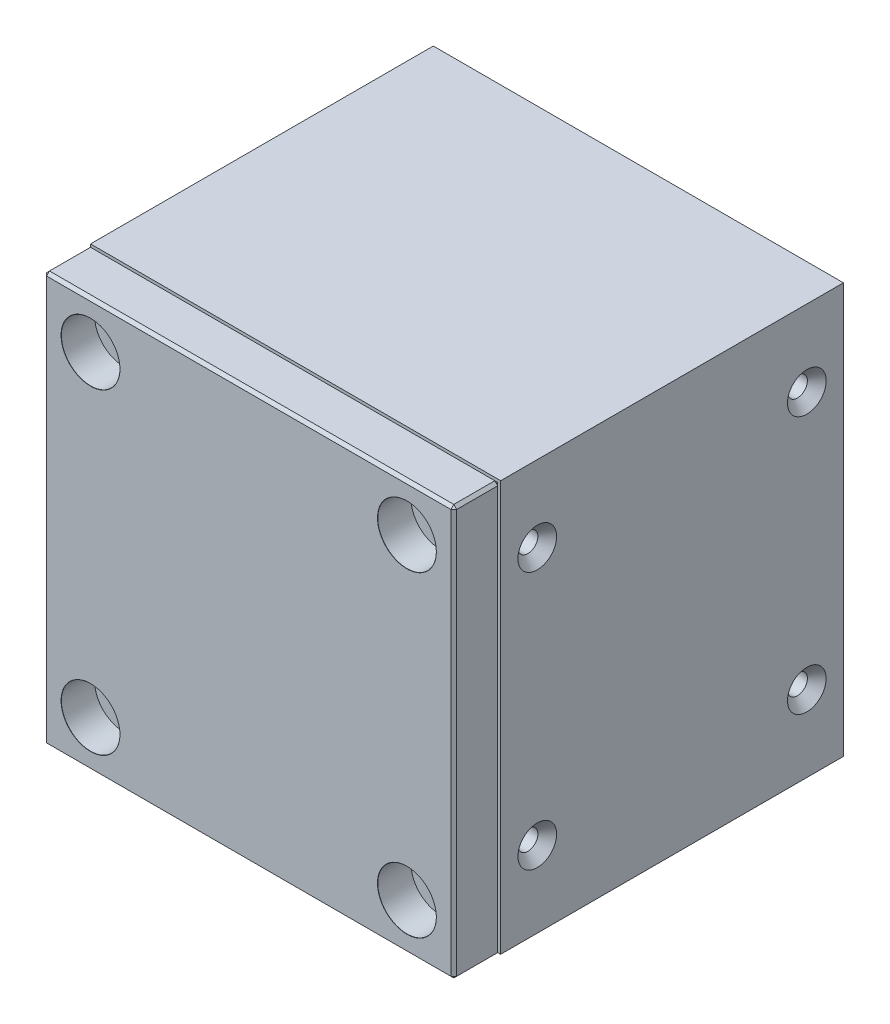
ISO-10303-21;
HEADER;
FILE_DESCRIPTION(('STEP AP214'),'2;1');
FILE_NAME('part.step','',(''),(''),'','','');
FILE_SCHEMA(('AUTOMOTIVE_DESIGN { 1 0 10303 214 1 1 1 1 }'));
ENDSEC;
DATA;
#1=APPLICATION_CONTEXT('core data for automotive mechanical design processes');
#2=APPLICATION_PROTOCOL_DEFINITION('international standard','automotive_design',2000,#1);
#3=PRODUCT_CONTEXT('',#1,'mechanical');
#4=PRODUCT('Part','Part','',(#3));
#5=PRODUCT_RELATED_PRODUCT_CATEGORY('part','',(#4));
#6=PRODUCT_DEFINITION_FORMATION('','',#4);
#7=PRODUCT_DEFINITION_CONTEXT('part definition',#1,'design');
#8=PRODUCT_DEFINITION('design','',#6,#7);
#9=PRODUCT_DEFINITION_SHAPE('','',#8);
#10=(LENGTH_UNIT() NAMED_UNIT(*) SI_UNIT(.MILLI.,.METRE.));
#11=(NAMED_UNIT(*) PLANE_ANGLE_UNIT() SI_UNIT($,.RADIAN.));
#12=(NAMED_UNIT(*) SI_UNIT($,.STERADIAN.) SOLID_ANGLE_UNIT());
#13=UNCERTAINTY_MEASURE_WITH_UNIT(LENGTH_MEASURE(1.E-05),#10,'distance_accuracy_value','');
#14=(GEOMETRIC_REPRESENTATION_CONTEXT(3) GLOBAL_UNCERTAINTY_ASSIGNED_CONTEXT((#13)) GLOBAL_UNIT_ASSIGNED_CONTEXT((#10,
#11,#12)) REPRESENTATION_CONTEXT('',''));
#15=CARTESIAN_POINT('',(0.,0.,0.));
#16=DIRECTION('',(0.,0.,1.));
#17=DIRECTION('',(1.,0.,0.));
#18=AXIS2_PLACEMENT_3D('',#15,#16,#17);
#19=CARTESIAN_POINT('',(35.,-35.,66.5));
#20=DIRECTION('',(-1.,0.,0.));
#21=DIRECTION('',(0.,0.,1.));
#22=AXIS2_PLACEMENT_3D('',#19,#20,#21);
#23=PLANE('',#22);
#24=DIRECTION('',(0.,1.,0.));
#25=VECTOR('',#24,1.);
#26=CARTESIAN_POINT('',(35.,35.,59.));
#27=LINE('',#26,#25);
#28=CARTESIAN_POINT('',(35.,-34.5,59.));
#29=VERTEX_POINT('',#28);
#30=CARTESIAN_POINT('',(35.,34.5,59.));
#31=VERTEX_POINT('',#30);
#32=EDGE_CURVE('E184',#29,#31,#27,.T.);
#33=ORIENTED_EDGE('',*,*,#32,.T.);
#34=DIRECTION('',(0.,0.,1.));
#35=VECTOR('',#34,1.);
#36=CARTESIAN_POINT('',(35.,34.5,66.5));
#37=LINE('',#36,#35);
#38=CARTESIAN_POINT('',(35.,34.5,66.));
#39=VERTEX_POINT('',#38);
#40=EDGE_CURVE('E186',#31,#39,#37,.T.);
#41=ORIENTED_EDGE('',*,*,#40,.T.);
#42=DIRECTION('',(0.,-1.,0.));
#43=VECTOR('',#42,1.);
#44=CARTESIAN_POINT('',(35.,-35.,66.));
#45=LINE('',#44,#43);
#46=CARTESIAN_POINT('',(35.,-34.5,66.));
#47=VERTEX_POINT('',#46);
#48=EDGE_CURVE('E180',#39,#47,#45,.T.);
#49=ORIENTED_EDGE('',*,*,#48,.T.);
#50=DIRECTION('',(0.,0.,-1.));
#51=VECTOR('',#50,1.);
#52=CARTESIAN_POINT('',(35.,-34.5,66.5));
#53=LINE('',#52,#51);
#54=EDGE_CURVE('E182',#47,#29,#53,.T.);
#55=ORIENTED_EDGE('',*,*,#54,.T.);
#56=EDGE_LOOP('',(#33,#41,#49,#55));
#57=FACE_BOUND('',#56,.T.);
#58=ADVANCED_FACE('F44',(#57),#23,.F.);
#59=CARTESIAN_POINT('',(-35.,35.,66.5));
#60=DIRECTION('',(0.,-1.,0.));
#61=DIRECTION('',(0.,0.,-1.));
#62=AXIS2_PLACEMENT_3D('',#59,#60,#61);
#63=PLANE('',#62);
#64=DIRECTION('',(0.,0.,-1.));
#65=VECTOR('',#64,1.);
#66=CARTESIAN_POINT('',(34.5,35.,66.5));
#67=LINE('',#66,#65);
#68=CARTESIAN_POINT('',(34.5,35.,66.));
#69=VERTEX_POINT('',#68);
#70=CARTESIAN_POINT('',(34.5,35.,59.));
#71=VERTEX_POINT('',#70);
#72=EDGE_CURVE('E167',#69,#71,#67,.T.);
#73=ORIENTED_EDGE('',*,*,#72,.T.);
#74=DIRECTION('',(-1.,0.,0.));
#75=VECTOR('',#74,1.);
#76=CARTESIAN_POINT('',(-35.,35.,59.));
#77=LINE('',#76,#75);
#78=CARTESIAN_POINT('',(-34.5,35.,59.));
#79=VERTEX_POINT('',#78);
#80=EDGE_CURVE('E138',#71,#79,#77,.T.);
#81=ORIENTED_EDGE('',*,*,#80,.T.);
#82=DIRECTION('',(0.,0.,1.));
#83=VECTOR('',#82,1.);
#84=CARTESIAN_POINT('',(-34.5,35.,66.5));
#85=LINE('',#84,#83);
#86=CARTESIAN_POINT('',(-34.5,35.,66.));
#87=VERTEX_POINT('',#86);
#88=EDGE_CURVE('E157',#79,#87,#85,.T.);
#89=ORIENTED_EDGE('',*,*,#88,.T.);
#90=DIRECTION('',(1.,0.,0.));
#91=VECTOR('',#90,1.);
#92=CARTESIAN_POINT('',(-35.,35.,66.));
#93=LINE('',#92,#91);
#94=EDGE_CURVE('E163',#87,#69,#93,.T.);
#95=ORIENTED_EDGE('',*,*,#94,.T.);
#96=EDGE_LOOP('',(#73,#81,#89,#95));
#97=FACE_BOUND('',#96,.T.);
#98=ADVANCED_FACE('F165',(#97),#63,.F.);
#99=CARTESIAN_POINT('',(-35.,-35.,66.5));
#100=DIRECTION('',(1.,0.,0.));
#101=DIRECTION('',(0.,0.,-1.));
#102=AXIS2_PLACEMENT_3D('',#99,#100,#101);
#103=PLANE('',#102);
#104=DIRECTION('',(0.,1.,0.));
#105=VECTOR('',#104,1.);
#106=CARTESIAN_POINT('',(-35.,-35.,66.));
#107=LINE('',#106,#105);
#108=CARTESIAN_POINT('',(-35.,-34.5,66.));
#109=VERTEX_POINT('',#108);
#110=CARTESIAN_POINT('',(-35.,34.5,66.));
#111=VERTEX_POINT('',#110);
#112=EDGE_CURVE('E53',#109,#111,#107,.T.);
#113=ORIENTED_EDGE('',*,*,#112,.T.);
#114=DIRECTION('',(0.,0.,-1.));
#115=VECTOR('',#114,1.);
#116=CARTESIAN_POINT('',(-35.,34.5,66.5));
#117=LINE('',#116,#115);
#118=CARTESIAN_POINT('',(-35.,34.5,59.));
#119=VERTEX_POINT('',#118);
#120=EDGE_CURVE('E12',#111,#119,#117,.T.);
#121=ORIENTED_EDGE('',*,*,#120,.T.);
#122=DIRECTION('',(0.,-1.,0.));
#123=VECTOR('',#122,1.);
#124=CARTESIAN_POINT('',(-35.,-35.,59.));
#125=LINE('',#124,#123);
#126=CARTESIAN_POINT('',(-35.,-34.5,59.));
#127=VERTEX_POINT('',#126);
#128=EDGE_CURVE('E207',#119,#127,#125,.T.);
#129=ORIENTED_EDGE('',*,*,#128,.T.);
#130=DIRECTION('',(0.,0.,1.));
#131=VECTOR('',#130,1.);
#132=CARTESIAN_POINT('',(-35.,-34.5,66.5));
#133=LINE('',#132,#131);
#134=EDGE_CURVE('E64',#127,#109,#133,.T.);
#135=ORIENTED_EDGE('',*,*,#134,.T.);
#136=EDGE_LOOP('',(#113,#121,#129,#135));
#137=FACE_BOUND('',#136,.T.);
#138=ADVANCED_FACE('F350',(#137),#103,.F.);
#139=CARTESIAN_POINT('',(-35.,-35.,66.5));
#140=DIRECTION('',(0.,1.,0.));
#141=DIRECTION('',(0.,0.,1.));
#142=AXIS2_PLACEMENT_3D('',#139,#140,#141);
#143=PLANE('',#142);
#144=DIRECTION('',(1.,0.,0.));
#145=VECTOR('',#144,1.);
#146=CARTESIAN_POINT('',(35.,-35.,59.));
#147=LINE('',#146,#145);
#148=CARTESIAN_POINT('',(-34.5,-35.,59.));
#149=VERTEX_POINT('',#148);
#150=CARTESIAN_POINT('',(34.5,-35.,59.));
#151=VERTEX_POINT('',#150);
#152=EDGE_CURVE('E193',#149,#151,#147,.T.);
#153=ORIENTED_EDGE('',*,*,#152,.T.);
#154=DIRECTION('',(0.,0.,1.));
#155=VECTOR('',#154,1.);
#156=CARTESIAN_POINT('',(34.5,-35.,66.5));
#157=LINE('',#156,#155);
#158=CARTESIAN_POINT('',(34.5,-35.,66.));
#159=VERTEX_POINT('',#158);
#160=EDGE_CURVE('E195',#151,#159,#157,.T.);
#161=ORIENTED_EDGE('',*,*,#160,.T.);
#162=DIRECTION('',(-1.,0.,0.));
#163=VECTOR('',#162,1.);
#164=CARTESIAN_POINT('',(-35.,-35.,66.));
#165=LINE('',#164,#163);
#166=CARTESIAN_POINT('',(-34.5,-35.,66.));
#167=VERTEX_POINT('',#166);
#168=EDGE_CURVE('E191',#159,#167,#165,.T.);
#169=ORIENTED_EDGE('',*,*,#168,.T.);
#170=DIRECTION('',(0.,0.,-1.));
#171=VECTOR('',#170,1.);
#172=CARTESIAN_POINT('',(-34.5,-35.,66.5));
#173=LINE('',#172,#171);
#174=EDGE_CURVE('E189',#167,#149,#173,.T.);
#175=ORIENTED_EDGE('',*,*,#174,.T.);
#176=EDGE_LOOP('',(#153,#161,#169,#175));
#177=FACE_BOUND('',#176,.T.);
#178=ADVANCED_FACE('F278',(#177),#143,.F.);
#179=CARTESIAN_POINT('',(0.,0.,66.5));
#180=DIRECTION('',(0.,0.,-1.));
#181=DIRECTION('',(-1.,0.,0.));
#182=AXIS2_PLACEMENT_3D('',#179,#180,#181);
#183=PLANE('',#182);
#184=CARTESIAN_POINT('',(-27.,-27.,66.5));
#185=DIRECTION('',(0.,0.,1.));
#186=DIRECTION('',(1.,0.,0.));
#187=AXIS2_PLACEMENT_3D('',#184,#185,#186);
#188=CIRCLE('',#187,5.025);
#189=CARTESIAN_POINT('',(-21.975,-27.,66.5));
#190=VERTEX_POINT('',#189);
#191=EDGE_CURVE('E712',#190,#190,#188,.T.);
#192=ORIENTED_EDGE('',*,*,#191,.F.);
#193=EDGE_LOOP('',(#192));
#194=FACE_BOUND('',#193,.T.);
#195=CARTESIAN_POINT('',(-27.,27.,66.5));
#196=DIRECTION('',(0.,0.,1.));
#197=DIRECTION('',(1.,0.,0.));
#198=AXIS2_PLACEMENT_3D('',#195,#196,#197);
#199=CIRCLE('',#198,5.025);
#200=CARTESIAN_POINT('',(-21.975,27.,66.5));
#201=VERTEX_POINT('',#200);
#202=EDGE_CURVE('E725',#201,#201,#199,.T.);
#203=ORIENTED_EDGE('',*,*,#202,.F.);
#204=EDGE_LOOP('',(#203));
#205=FACE_BOUND('',#204,.T.);
#206=CARTESIAN_POINT('',(27.,27.,66.5));
#207=DIRECTION('',(0.,0.,1.));
#208=DIRECTION('',(1.,0.,0.));
#209=AXIS2_PLACEMENT_3D('',#206,#207,#208);
#210=CIRCLE('',#209,5.025);
#211=CARTESIAN_POINT('',(32.025,27.,66.5));
#212=VERTEX_POINT('',#211);
#213=EDGE_CURVE('E740',#212,#212,#210,.T.);
#214=ORIENTED_EDGE('',*,*,#213,.F.);
#215=EDGE_LOOP('',(#214));
#216=FACE_BOUND('',#215,.T.);
#217=CARTESIAN_POINT('',(27.,-27.,66.5));
#218=DIRECTION('',(0.,0.,1.));
#219=DIRECTION('',(1.,0.,0.));
#220=AXIS2_PLACEMENT_3D('',#217,#218,#219);
#221=CIRCLE('',#220,5.025);
#222=CARTESIAN_POINT('',(32.025,-27.,66.5));
#223=VERTEX_POINT('',#222);
#224=EDGE_CURVE('E755',#223,#223,#221,.T.);
#225=ORIENTED_EDGE('',*,*,#224,.F.);
#226=EDGE_LOOP('',(#225));
#227=FACE_BOUND('',#226,.T.);
#228=DIRECTION('',(0.,-1.,0.));
#229=VECTOR('',#228,1.);
#230=CARTESIAN_POINT('',(-34.5,0.,66.5));
#231=LINE('',#230,#229);
#232=CARTESIAN_POINT('',(-34.5,34.5,66.5));
#233=VERTEX_POINT('',#232);
#234=CARTESIAN_POINT('',(-34.5,-34.5,66.5));
#235=VERTEX_POINT('',#234);
#236=EDGE_CURVE('E198',#233,#235,#231,.T.);
#237=ORIENTED_EDGE('',*,*,#236,.T.);
#238=DIRECTION('',(1.,0.,0.));
#239=VECTOR('',#238,1.);
#240=CARTESIAN_POINT('',(0.,-34.5,66.5));
#241=LINE('',#240,#239);
#242=CARTESIAN_POINT('',(34.5,-34.5,66.5));
#243=VERTEX_POINT('',#242);
#244=EDGE_CURVE('E204',#235,#243,#241,.T.);
#245=ORIENTED_EDGE('',*,*,#244,.T.);
#246=DIRECTION('',(0.,1.,0.));
#247=VECTOR('',#246,1.);
#248=CARTESIAN_POINT('',(34.5,0.,66.5));
#249=LINE('',#248,#247);
#250=CARTESIAN_POINT('',(34.5,34.5,66.5));
#251=VERTEX_POINT('',#250);
#252=EDGE_CURVE('E202',#243,#251,#249,.T.);
#253=ORIENTED_EDGE('',*,*,#252,.T.);
#254=DIRECTION('',(-1.,0.,0.));
#255=VECTOR('',#254,1.);
#256=CARTESIAN_POINT('',(0.,34.5,66.5));
#257=LINE('',#256,#255);
#258=EDGE_CURVE('E200',#251,#233,#257,.T.);
#259=ORIENTED_EDGE('',*,*,#258,.T.);
#260=EDGE_LOOP('',(#237,#245,#253,#259));
#261=FACE_BOUND('',#260,.T.);
#262=ADVANCED_FACE('F312',(#194,#205,#216,#227,#261),#183,.F.);
#263=CARTESIAN_POINT('',(0.,0.,58.5));
#264=DIRECTION('',(0.,0.,-1.));
#265=DIRECTION('',(-1.,0.,0.));
#266=AXIS2_PLACEMENT_3D('',#263,#264,#265);
#267=PLANE('',#266);
#268=CARTESIAN_POINT('',(-27.,-27.,58.5));
#269=DIRECTION('',(0.,0.,-1.));
#270=DIRECTION('',(-1.,0.,0.));
#271=AXIS2_PLACEMENT_3D('',#268,#269,#270);
#272=CIRCLE('',#271,2.75);
#273=CARTESIAN_POINT('',(-29.75,-27.,58.5));
#274=VERTEX_POINT('',#273);
#275=EDGE_CURVE('E722',#274,#274,#272,.T.);
#276=ORIENTED_EDGE('',*,*,#275,.F.);
#277=EDGE_LOOP('',(#276));
#278=FACE_BOUND('',#277,.T.);
#279=CARTESIAN_POINT('',(-27.,27.,58.5));
#280=DIRECTION('',(0.,0.,-1.));
#281=DIRECTION('',(-1.,0.,0.));
#282=AXIS2_PLACEMENT_3D('',#279,#280,#281);
#283=CIRCLE('',#282,2.75);
#284=CARTESIAN_POINT('',(-29.75,27.,58.5));
#285=VERTEX_POINT('',#284);
#286=EDGE_CURVE('E737',#285,#285,#283,.T.);
#287=ORIENTED_EDGE('',*,*,#286,.F.);
#288=EDGE_LOOP('',(#287));
#289=FACE_BOUND('',#288,.T.);
#290=CARTESIAN_POINT('',(27.,27.,58.5));
#291=DIRECTION('',(0.,0.,-1.));
#292=DIRECTION('',(-1.,0.,0.));
#293=AXIS2_PLACEMENT_3D('',#290,#291,#292);
#294=CIRCLE('',#293,2.75);
#295=CARTESIAN_POINT('',(24.25,27.,58.5));
#296=VERTEX_POINT('',#295);
#297=EDGE_CURVE('E752',#296,#296,#294,.T.);
#298=ORIENTED_EDGE('',*,*,#297,.F.);
#299=EDGE_LOOP('',(#298));
#300=FACE_BOUND('',#299,.T.);
#301=CARTESIAN_POINT('',(27.,-27.,58.5));
#302=DIRECTION('',(0.,0.,-1.));
#303=DIRECTION('',(-1.,0.,0.));
#304=AXIS2_PLACEMENT_3D('',#301,#302,#303);
#305=CIRCLE('',#304,2.75);
#306=CARTESIAN_POINT('',(24.25,-27.,58.5));
#307=VERTEX_POINT('',#306);
#308=EDGE_CURVE('E143',#307,#307,#305,.T.);
#309=ORIENTED_EDGE('',*,*,#308,.F.);
#310=EDGE_LOOP('',(#309));
#311=FACE_BOUND('',#310,.T.);
#312=DIRECTION('',(0.,1.,0.));
#313=VECTOR('',#312,1.);
#314=CARTESIAN_POINT('',(-34.5,35.,58.5));
#315=LINE('',#314,#313);
#316=CARTESIAN_POINT('',(-34.5,-34.5,58.5));
#317=VERTEX_POINT('',#316);
#318=CARTESIAN_POINT('',(-34.5,34.5,58.5));
#319=VERTEX_POINT('',#318);
#320=EDGE_CURVE('E169',#317,#319,#315,.T.);
#321=ORIENTED_EDGE('',*,*,#320,.T.);
#322=DIRECTION('',(1.,0.,0.));
#323=VECTOR('',#322,1.);
#324=CARTESIAN_POINT('',(35.,34.5,58.5));
#325=LINE('',#324,#323);
#326=CARTESIAN_POINT('',(34.5,34.5,58.5));
#327=VERTEX_POINT('',#326);
#328=EDGE_CURVE('E140',#319,#327,#325,.T.);
#329=ORIENTED_EDGE('',*,*,#328,.T.);
#330=DIRECTION('',(0.,-1.,0.));
#331=VECTOR('',#330,1.);
#332=CARTESIAN_POINT('',(34.5,-35.,58.5));
#333=LINE('',#332,#331);
#334=CARTESIAN_POINT('',(34.5,-34.5,58.5));
#335=VERTEX_POINT('',#334);
#336=EDGE_CURVE('E177',#327,#335,#333,.T.);
#337=ORIENTED_EDGE('',*,*,#336,.T.);
#338=DIRECTION('',(-1.,0.,0.));
#339=VECTOR('',#338,1.);
#340=CARTESIAN_POINT('',(-35.,-34.5,58.5));
#341=LINE('',#340,#339);
#342=EDGE_CURVE('E171',#335,#317,#341,.T.);
#343=ORIENTED_EDGE('',*,*,#342,.T.);
#344=EDGE_LOOP('',(#321,#329,#337,#343));
#345=FACE_BOUND('',#344,.T.);
#346=ADVANCED_FACE('F332',(#278,#289,#300,#311,#345),#267,.T.);
#347=CARTESIAN_POINT('',(0.,-34.5,66.5));
#348=DIRECTION('',(0.,0.707106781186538,-0.707106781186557));
#349=DIRECTION('',(1.,0.,0.));
#350=AXIS2_PLACEMENT_3D('',#347,#348,#349);
#351=PLANE('',#350);
#352=DIRECTION('',(0.,0.707106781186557,0.707106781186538));
#353=VECTOR('',#352,1.);
#354=CARTESIAN_POINT('',(34.5,-35.,66.));
#355=LINE('',#354,#353);
#356=EDGE_CURVE('E48',#243,#159,#355,.F.);
#357=ORIENTED_EDGE('',*,*,#356,.F.);
#358=ORIENTED_EDGE('',*,*,#244,.F.);
#359=DIRECTION('',(0.,-0.707106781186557,-0.707106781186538));
#360=VECTOR('',#359,1.);
#361=CARTESIAN_POINT('',(-34.5,-35.,66.));
#362=LINE('',#361,#360);
#363=EDGE_CURVE('E260',#167,#235,#362,.F.);
#364=ORIENTED_EDGE('',*,*,#363,.F.);
#365=ORIENTED_EDGE('',*,*,#168,.F.);
#366=EDGE_LOOP('',(#357,#358,#364,#365));
#367=FACE_BOUND('',#366,.T.);
#368=ADVANCED_FACE('F46',(#367),#351,.F.);
#369=CARTESIAN_POINT('',(34.5,-35.,66.));
#370=DIRECTION('',(0.577350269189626,-0.57735026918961,0.577350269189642));
#371=DIRECTION('',(0.707106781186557,0.,-0.707106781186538));
#372=AXIS2_PLACEMENT_3D('',#369,#370,#371);
#373=PLANE('',#372);
#374=DIRECTION('',(0.707106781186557,0.,-0.707106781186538));
#375=VECTOR('',#374,1.);
#376=CARTESIAN_POINT('',(34.75,-34.5,66.25));
#377=LINE('',#376,#375);
#378=EDGE_CURVE('E256',#243,#47,#377,.T.);
#379=ORIENTED_EDGE('',*,*,#378,.F.);
#380=ORIENTED_EDGE('',*,*,#356,.T.);
#381=DIRECTION('',(-0.707106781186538,-0.707106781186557,0.));
#382=VECTOR('',#381,1.);
#383=CARTESIAN_POINT('',(34.5,-35.,66.));
#384=LINE('',#383,#382);
#385=EDGE_CURVE('E259',#47,#159,#384,.T.);
#386=ORIENTED_EDGE('',*,*,#385,.F.);
#387=EDGE_LOOP('',(#379,#380,#386));
#388=FACE_BOUND('',#387,.T.);
#389=ADVANCED_FACE('F272',(#388),#373,.T.);
#390=CARTESIAN_POINT('',(-34.5,-35.,66.));
#391=DIRECTION('',(-0.577350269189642,-0.57735026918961,0.577350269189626));
#392=DIRECTION('',(0.707106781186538,0.,0.707106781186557));
#393=AXIS2_PLACEMENT_3D('',#390,#391,#392);
#394=PLANE('',#393);
#395=DIRECTION('',(-0.707106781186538,0.707106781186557,0.));
#396=VECTOR('',#395,1.);
#397=CARTESIAN_POINT('',(-34.5,-35.,66.));
#398=LINE('',#397,#396);
#399=EDGE_CURVE('E251',#167,#109,#398,.T.);
#400=ORIENTED_EDGE('',*,*,#399,.F.);
#401=ORIENTED_EDGE('',*,*,#363,.T.);
#402=DIRECTION('',(0.707106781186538,0.,0.707106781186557));
#403=VECTOR('',#402,1.);
#404=CARTESIAN_POINT('',(-34.75,-34.5,66.25));
#405=LINE('',#404,#403);
#406=EDGE_CURVE('E253',#109,#235,#405,.T.);
#407=ORIENTED_EDGE('',*,*,#406,.F.);
#408=EDGE_LOOP('',(#400,#401,#407));
#409=FACE_BOUND('',#408,.T.);
#410=ADVANCED_FACE('F321',(#409),#394,.T.);
#411=CARTESIAN_POINT('',(35.,-34.5,66.5));
#412=DIRECTION('',(-0.707106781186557,0.707106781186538,0.));
#413=DIRECTION('',(0.,0.,-1.));
#414=AXIS2_PLACEMENT_3D('',#411,#412,#413);
#415=PLANE('',#414);
#416=ORIENTED_EDGE('',*,*,#385,.T.);
#417=ORIENTED_EDGE('',*,*,#160,.F.);
#418=DIRECTION('',(0.707106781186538,0.707106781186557,0.));
#419=VECTOR('',#418,1.);
#420=CARTESIAN_POINT('',(34.75,-34.75,59.));
#421=LINE('',#420,#419);
#422=EDGE_CURVE('E245',#29,#151,#421,.F.);
#423=ORIENTED_EDGE('',*,*,#422,.F.);
#424=ORIENTED_EDGE('',*,*,#54,.F.);
#425=EDGE_LOOP('',(#416,#417,#423,#424));
#426=FACE_BOUND('',#425,.T.);
#427=ADVANCED_FACE('F283',(#426),#415,.F.);
#428=CARTESIAN_POINT('',(34.5,0.,66.5));
#429=DIRECTION('',(-0.707106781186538,0.,-0.707106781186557));
#430=DIRECTION('',(0.,1.,0.));
#431=AXIS2_PLACEMENT_3D('',#428,#429,#430);
#432=PLANE('',#431);
#433=ORIENTED_EDGE('',*,*,#378,.T.);
#434=ORIENTED_EDGE('',*,*,#48,.F.);
#435=DIRECTION('',(-0.707106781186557,0.,0.707106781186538));
#436=VECTOR('',#435,1.);
#437=CARTESIAN_POINT('',(35.,34.5,66.));
#438=LINE('',#437,#436);
#439=EDGE_CURVE('E242',#251,#39,#438,.F.);
#440=ORIENTED_EDGE('',*,*,#439,.F.);
#441=ORIENTED_EDGE('',*,*,#252,.F.);
#442=EDGE_LOOP('',(#433,#434,#440,#441));
#443=FACE_BOUND('',#442,.T.);
#444=ADVANCED_FACE('F309',(#443),#432,.F.);
#445=CARTESIAN_POINT('',(0.,34.5,66.5));
#446=DIRECTION('',(0.,-0.707106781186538,-0.707106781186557));
#447=DIRECTION('',(-1.,0.,0.));
#448=AXIS2_PLACEMENT_3D('',#445,#446,#447);
#449=PLANE('',#448);
#450=DIRECTION('',(0.,-0.707106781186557,0.707106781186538));
#451=VECTOR('',#450,1.);
#452=CARTESIAN_POINT('',(-34.5,34.5,66.5));
#453=LINE('',#452,#451);
#454=EDGE_CURVE('E236',#233,#87,#453,.F.);
#455=ORIENTED_EDGE('',*,*,#454,.F.);
#456=ORIENTED_EDGE('',*,*,#258,.F.);
#457=DIRECTION('',(0.,0.707106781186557,-0.707106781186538));
#458=VECTOR('',#457,1.);
#459=CARTESIAN_POINT('',(34.5,34.75,66.25));
#460=LINE('',#459,#458);
#461=EDGE_CURVE('E239',#69,#251,#460,.F.);
#462=ORIENTED_EDGE('',*,*,#461,.F.);
#463=ORIENTED_EDGE('',*,*,#94,.F.);
#464=EDGE_LOOP('',(#455,#456,#462,#463));
#465=FACE_BOUND('',#464,.T.);
#466=ADVANCED_FACE('F316',(#465),#449,.F.);
#467=CARTESIAN_POINT('',(-34.5,0.,66.5));
#468=DIRECTION('',(0.707106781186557,0.,-0.707106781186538));
#469=DIRECTION('',(0.,-1.,0.));
#470=AXIS2_PLACEMENT_3D('',#467,#468,#469);
#471=PLANE('',#470);
#472=ORIENTED_EDGE('',*,*,#406,.T.);
#473=ORIENTED_EDGE('',*,*,#236,.F.);
#474=DIRECTION('',(-0.707106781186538,0.,-0.707106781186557));
#475=VECTOR('',#474,1.);
#476=CARTESIAN_POINT('',(-34.5,34.5,66.5));
#477=LINE('',#476,#475);
#478=EDGE_CURVE('E233',#111,#233,#477,.F.);
#479=ORIENTED_EDGE('',*,*,#478,.F.);
#480=ORIENTED_EDGE('',*,*,#112,.F.);
#481=EDGE_LOOP('',(#472,#473,#479,#480));
#482=FACE_BOUND('',#481,.T.);
#483=ADVANCED_FACE('F320',(#482),#471,.F.);
#484=CARTESIAN_POINT('',(-34.5,-35.,66.5));
#485=DIRECTION('',(0.707106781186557,0.707106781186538,0.));
#486=DIRECTION('',(0.,0.,-1.));
#487=AXIS2_PLACEMENT_3D('',#484,#485,#486);
#488=PLANE('',#487);
#489=ORIENTED_EDGE('',*,*,#399,.T.);
#490=ORIENTED_EDGE('',*,*,#134,.F.);
#491=DIRECTION('',(0.707106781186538,-0.707106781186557,0.));
#492=VECTOR('',#491,1.);
#493=CARTESIAN_POINT('',(-34.75,-34.75,59.));
#494=LINE('',#493,#492);
#495=EDGE_CURVE('E230',#149,#127,#494,.F.);
#496=ORIENTED_EDGE('',*,*,#495,.F.);
#497=ORIENTED_EDGE('',*,*,#174,.F.);
#498=EDGE_LOOP('',(#489,#490,#496,#497));
#499=FACE_BOUND('',#498,.T.);
#500=ADVANCED_FACE('F324',(#499),#488,.F.);
#501=CARTESIAN_POINT('',(-35.,-35.,59.));
#502=DIRECTION('',(0.,-0.707106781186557,-0.707106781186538));
#503=DIRECTION('',(-1.,0.,0.));
#504=AXIS2_PLACEMENT_3D('',#501,#502,#503);
#505=PLANE('',#504);
#506=DIRECTION('',(0.,0.707106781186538,-0.707106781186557));
#507=VECTOR('',#506,1.);
#508=CARTESIAN_POINT('',(34.5,-34.5,58.5));
#509=LINE('',#508,#507);
#510=EDGE_CURVE('E248',#151,#335,#509,.T.);
#511=ORIENTED_EDGE('',*,*,#510,.F.);
#512=ORIENTED_EDGE('',*,*,#152,.F.);
#513=DIRECTION('',(0.,-0.707106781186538,0.707106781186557));
#514=VECTOR('',#513,1.);
#515=CARTESIAN_POINT('',(-34.5,-34.5,58.5));
#516=LINE('',#515,#514);
#517=EDGE_CURVE('E227',#317,#149,#516,.T.);
#518=ORIENTED_EDGE('',*,*,#517,.F.);
#519=ORIENTED_EDGE('',*,*,#342,.F.);
#520=EDGE_LOOP('',(#511,#512,#518,#519));
#521=FACE_BOUND('',#520,.T.);
#522=ADVANCED_FACE('F287',(#521),#505,.T.);
#523=CARTESIAN_POINT('',(34.5,-34.5,58.5));
#524=DIRECTION('',(0.577350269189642,-0.577350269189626,-0.57735026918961));
#525=DIRECTION('',(0.707106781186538,0.707106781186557,0.));
#526=AXIS2_PLACEMENT_3D('',#523,#524,#525);
#527=PLANE('',#526);
#528=ORIENTED_EDGE('',*,*,#422,.T.);
#529=ORIENTED_EDGE('',*,*,#510,.T.);
#530=DIRECTION('',(0.707106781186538,0.,0.707106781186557));
#531=VECTOR('',#530,1.);
#532=CARTESIAN_POINT('',(34.5,-34.5,58.5));
#533=LINE('',#532,#531);
#534=EDGE_CURVE('E224',#29,#335,#533,.F.);
#535=ORIENTED_EDGE('',*,*,#534,.F.);
#536=EDGE_LOOP('',(#528,#529,#535));
#537=FACE_BOUND('',#536,.T.);
#538=ADVANCED_FACE('F291',(#537),#527,.T.);
#539=CARTESIAN_POINT('',(35.,34.5,66.));
#540=DIRECTION('',(0.57735026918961,0.577350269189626,0.577350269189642));
#541=DIRECTION('',(0.,-0.707106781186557,0.707106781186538));
#542=AXIS2_PLACEMENT_3D('',#539,#540,#541);
#543=PLANE('',#542);
#544=ORIENTED_EDGE('',*,*,#461,.T.);
#545=ORIENTED_EDGE('',*,*,#439,.T.);
#546=DIRECTION('',(0.707106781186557,-0.707106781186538,0.));
#547=VECTOR('',#546,1.);
#548=CARTESIAN_POINT('',(35.,34.5,66.));
#549=LINE('',#548,#547);
#550=EDGE_CURVE('E222',#69,#39,#549,.T.);
#551=ORIENTED_EDGE('',*,*,#550,.F.);
#552=EDGE_LOOP('',(#544,#545,#551));
#553=FACE_BOUND('',#552,.T.);
#554=ADVANCED_FACE('F306',(#553),#543,.T.);
#555=CARTESIAN_POINT('',(-34.5,34.5,66.5));
#556=DIRECTION('',(-0.577350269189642,0.57735026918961,0.577350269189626));
#557=DIRECTION('',(0.707106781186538,0.,0.707106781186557));
#558=AXIS2_PLACEMENT_3D('',#555,#556,#557);
#559=PLANE('',#558);
#560=ORIENTED_EDGE('',*,*,#478,.T.);
#561=ORIENTED_EDGE('',*,*,#454,.T.);
#562=DIRECTION('',(0.707106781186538,0.707106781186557,0.));
#563=VECTOR('',#562,1.);
#564=CARTESIAN_POINT('',(-34.75,34.75,66.));
#565=LINE('',#564,#563);
#566=EDGE_CURVE('E160',#111,#87,#565,.T.);
#567=ORIENTED_EDGE('',*,*,#566,.F.);
#568=EDGE_LOOP('',(#560,#561,#567));
#569=FACE_BOUND('',#568,.T.);
#570=ADVANCED_FACE('F318',(#569),#559,.T.);
#571=CARTESIAN_POINT('',(-34.5,-34.5,58.5));
#572=DIRECTION('',(-0.577350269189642,-0.577350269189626,-0.57735026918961));
#573=DIRECTION('',(0.707106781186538,-0.707106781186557,0.));
#574=AXIS2_PLACEMENT_3D('',#571,#572,#573);
#575=PLANE('',#574);
#576=ORIENTED_EDGE('',*,*,#517,.T.);
#577=ORIENTED_EDGE('',*,*,#495,.T.);
#578=DIRECTION('',(0.707106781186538,0.,-0.707106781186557));
#579=VECTOR('',#578,1.);
#580=CARTESIAN_POINT('',(-34.5,-34.5,58.5));
#581=LINE('',#580,#579);
#582=EDGE_CURVE('E218',#317,#127,#581,.F.);
#583=ORIENTED_EDGE('',*,*,#582,.F.);
#584=EDGE_LOOP('',(#576,#577,#583));
#585=FACE_BOUND('',#584,.T.);
#586=ADVANCED_FACE('F327',(#585),#575,.T.);
#587=CARTESIAN_POINT('',(35.,-35.,59.));
#588=DIRECTION('',(0.707106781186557,0.,-0.707106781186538));
#589=DIRECTION('',(0.,-1.,0.));
#590=AXIS2_PLACEMENT_3D('',#587,#588,#589);
#591=PLANE('',#590);
#592=ORIENTED_EDGE('',*,*,#534,.T.);
#593=ORIENTED_EDGE('',*,*,#336,.F.);
#594=DIRECTION('',(-0.707106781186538,0.,-0.707106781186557));
#595=VECTOR('',#594,1.);
#596=CARTESIAN_POINT('',(34.5,34.5,58.5));
#597=LINE('',#596,#595);
#598=EDGE_CURVE('E215',#31,#327,#597,.T.);
#599=ORIENTED_EDGE('',*,*,#598,.F.);
#600=ORIENTED_EDGE('',*,*,#32,.F.);
#601=EDGE_LOOP('',(#592,#593,#599,#600));
#602=FACE_BOUND('',#601,.T.);
#603=ADVANCED_FACE('F296',(#602),#591,.T.);
#604=CARTESIAN_POINT('',(34.5,35.,66.5));
#605=DIRECTION('',(-0.707106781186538,-0.707106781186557,0.));
#606=DIRECTION('',(0.,0.,-1.));
#607=AXIS2_PLACEMENT_3D('',#604,#605,#606);
#608=PLANE('',#607);
#609=ORIENTED_EDGE('',*,*,#550,.T.);
#610=ORIENTED_EDGE('',*,*,#40,.F.);
#611=DIRECTION('',(-0.707106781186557,0.707106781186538,0.));
#612=VECTOR('',#611,1.);
#613=CARTESIAN_POINT('',(34.75,34.75,59.));
#614=LINE('',#613,#612);
#615=EDGE_CURVE('E154',#71,#31,#614,.F.);
#616=ORIENTED_EDGE('',*,*,#615,.F.);
#617=ORIENTED_EDGE('',*,*,#72,.F.);
#618=EDGE_LOOP('',(#609,#610,#616,#617));
#619=FACE_BOUND('',#618,.T.);
#620=ADVANCED_FACE('F300',(#619),#608,.F.);
#621=CARTESIAN_POINT('',(-35.,34.5,66.5));
#622=DIRECTION('',(0.707106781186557,-0.707106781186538,0.));
#623=DIRECTION('',(0.,0.,-1.));
#624=AXIS2_PLACEMENT_3D('',#621,#622,#623);
#625=PLANE('',#624);
#626=ORIENTED_EDGE('',*,*,#566,.T.);
#627=ORIENTED_EDGE('',*,*,#88,.F.);
#628=DIRECTION('',(-0.707106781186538,-0.707106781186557,0.));
#629=VECTOR('',#628,1.);
#630=CARTESIAN_POINT('',(-34.5,35.,59.));
#631=LINE('',#630,#629);
#632=EDGE_CURVE('E146',#119,#79,#631,.F.);
#633=ORIENTED_EDGE('',*,*,#632,.F.);
#634=ORIENTED_EDGE('',*,*,#120,.F.);
#635=EDGE_LOOP('',(#626,#627,#633,#634));
#636=FACE_BOUND('',#635,.T.);
#637=ADVANCED_FACE('F158',(#636),#625,.F.);
#638=CARTESIAN_POINT('',(-35.,-35.,59.));
#639=DIRECTION('',(-0.707106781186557,0.,-0.707106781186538));
#640=DIRECTION('',(0.,1.,0.));
#641=AXIS2_PLACEMENT_3D('',#638,#639,#640);
#642=PLANE('',#641);
#643=ORIENTED_EDGE('',*,*,#582,.T.);
#644=ORIENTED_EDGE('',*,*,#128,.F.);
#645=DIRECTION('',(-0.707106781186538,0.,0.707106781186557));
#646=VECTOR('',#645,1.);
#647=CARTESIAN_POINT('',(-34.75,34.5,58.75));
#648=LINE('',#647,#646);
#649=EDGE_CURVE('E150',#319,#119,#648,.T.);
#650=ORIENTED_EDGE('',*,*,#649,.F.);
#651=ORIENTED_EDGE('',*,*,#320,.F.);
#652=EDGE_LOOP('',(#643,#644,#650,#651));
#653=FACE_BOUND('',#652,.T.);
#654=ADVANCED_FACE('F330',(#653),#642,.T.);
#655=CARTESIAN_POINT('',(34.5,34.5,58.5));
#656=DIRECTION('',(0.577350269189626,0.577350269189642,-0.57735026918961));
#657=DIRECTION('',(-0.707106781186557,0.707106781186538,0.));
#658=AXIS2_PLACEMENT_3D('',#655,#656,#657);
#659=PLANE('',#658);
#660=ORIENTED_EDGE('',*,*,#615,.T.);
#661=ORIENTED_EDGE('',*,*,#598,.T.);
#662=DIRECTION('',(0.,0.707106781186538,0.707106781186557));
#663=VECTOR('',#662,1.);
#664=CARTESIAN_POINT('',(34.5,34.5,58.5));
#665=LINE('',#664,#663);
#666=EDGE_CURVE('E142',#71,#327,#665,.F.);
#667=ORIENTED_EDGE('',*,*,#666,.F.);
#668=EDGE_LOOP('',(#660,#661,#667));
#669=FACE_BOUND('',#668,.T.);
#670=ADVANCED_FACE('F359',(#669),#659,.T.);
#671=CARTESIAN_POINT('',(-34.5,35.,59.));
#672=DIRECTION('',(-0.577350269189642,0.577350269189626,-0.57735026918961));
#673=DIRECTION('',(-0.707106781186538,-0.707106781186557,0.));
#674=AXIS2_PLACEMENT_3D('',#671,#672,#673);
#675=PLANE('',#674);
#676=ORIENTED_EDGE('',*,*,#649,.T.);
#677=ORIENTED_EDGE('',*,*,#632,.T.);
#678=DIRECTION('',(0.,-0.707106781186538,-0.707106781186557));
#679=VECTOR('',#678,1.);
#680=CARTESIAN_POINT('',(-34.5,35.,59.));
#681=LINE('',#680,#679);
#682=EDGE_CURVE('E134',#319,#79,#681,.F.);
#683=ORIENTED_EDGE('',*,*,#682,.F.);
#684=EDGE_LOOP('',(#676,#677,#683));
#685=FACE_BOUND('',#684,.T.);
#686=ADVANCED_FACE('F148',(#685),#675,.T.);
#687=CARTESIAN_POINT('',(-35.,35.,59.));
#688=DIRECTION('',(0.,0.707106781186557,-0.707106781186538));
#689=DIRECTION('',(1.,0.,0.));
#690=AXIS2_PLACEMENT_3D('',#687,#688,#689);
#691=PLANE('',#690);
#692=ORIENTED_EDGE('',*,*,#666,.T.);
#693=ORIENTED_EDGE('',*,*,#328,.F.);
#694=ORIENTED_EDGE('',*,*,#682,.T.);
#695=ORIENTED_EDGE('',*,*,#80,.F.);
#696=EDGE_LOOP('',(#692,#693,#694,#695));
#697=FACE_BOUND('',#696,.T.);
#698=ADVANCED_FACE('F136',(#697),#691,.T.);
#699=CARTESIAN_POINT('',(27.,-27.,66.5));
#700=DIRECTION('',(0.,0.,1.));
#701=DIRECTION('',(1.,0.,0.));
#702=AXIS2_PLACEMENT_3D('',#699,#700,#701);
#703=CYLINDRICAL_SURFACE('',#702,2.75);
#704=CARTESIAN_POINT('',(27.,-27.,60.8));
#705=DIRECTION('',(0.,0.,1.));
#706=DIRECTION('',(1.,0.,0.));
#707=AXIS2_PLACEMENT_3D('',#704,#705,#706);
#708=CIRCLE('',#707,2.75);
#709=CARTESIAN_POINT('',(29.75,-27.,60.8));
#710=VERTEX_POINT('',#709);
#711=EDGE_CURVE('E764',#710,#710,#708,.T.);
#712=ORIENTED_EDGE('',*,*,#711,.T.);
#713=EDGE_LOOP('',(#712));
#714=FACE_BOUND('',#713,.T.);
#715=ORIENTED_EDGE('',*,*,#308,.T.);
#716=EDGE_LOOP('',(#715));
#717=FACE_BOUND('',#716,.T.);
#718=ADVANCED_FACE('F356',(#714,#717),#703,.F.);
#719=CARTESIAN_POINT('',(32.,-27.,60.8));
#720=DIRECTION('',(0.,0.,-1.));
#721=DIRECTION('',(-1.,0.,0.));
#722=AXIS2_PLACEMENT_3D('',#719,#720,#721);
#723=PLANE('',#722);
#724=ORIENTED_EDGE('',*,*,#711,.F.);
#725=EDGE_LOOP('',(#724));
#726=FACE_BOUND('',#725,.T.);
#727=CARTESIAN_POINT('',(27.,-27.,60.8));
#728=DIRECTION('',(0.,0.,1.));
#729=DIRECTION('',(1.,0.,0.));
#730=AXIS2_PLACEMENT_3D('',#727,#728,#729);
#731=CIRCLE('',#730,5.);
#732=CARTESIAN_POINT('',(32.,-27.,60.8));
#733=VERTEX_POINT('',#732);
#734=EDGE_CURVE('E761',#733,#733,#731,.T.);
#735=ORIENTED_EDGE('',*,*,#734,.T.);
#736=EDGE_LOOP('',(#735));
#737=FACE_BOUND('',#736,.T.);
#738=ADVANCED_FACE('F476',(#726,#737),#723,.F.);
#739=CARTESIAN_POINT('',(27.,-27.,66.5));
#740=DIRECTION('',(0.,0.,1.));
#741=DIRECTION('',(1.,0.,0.));
#742=AXIS2_PLACEMENT_3D('',#739,#740,#741);
#743=CYLINDRICAL_SURFACE('',#742,5.);
#744=ORIENTED_EDGE('',*,*,#734,.F.);
#745=EDGE_LOOP('',(#744));
#746=FACE_BOUND('',#745,.T.);
#747=CARTESIAN_POINT('',(27.,-27.,66.475));
#748=DIRECTION('',(0.,0.,1.));
#749=DIRECTION('',(1.,0.,0.));
#750=AXIS2_PLACEMENT_3D('',#747,#748,#749);
#751=CIRCLE('',#750,4.99999999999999);
#752=CARTESIAN_POINT('',(32.,-27.,66.475));
#753=VERTEX_POINT('',#752);
#754=EDGE_CURVE('E758',#753,#753,#751,.T.);
#755=ORIENTED_EDGE('',*,*,#754,.T.);
#756=EDGE_LOOP('',(#755));
#757=FACE_BOUND('',#756,.T.);
#758=ADVANCED_FACE('F484',(#746,#757),#743,.F.);
#759=CARTESIAN_POINT('',(27.,-27.,66.5));
#760=DIRECTION('',(0.,0.,1.));
#761=DIRECTION('',(1.,0.,0.));
#762=AXIS2_PLACEMENT_3D('',#759,#760,#761);
#763=CONICAL_SURFACE('',#762,5.025,0.785398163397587);
#764=ORIENTED_EDGE('',*,*,#754,.F.);
#765=EDGE_LOOP('',(#764));
#766=FACE_BOUND('',#765,.T.);
#767=ORIENTED_EDGE('',*,*,#224,.T.);
#768=EDGE_LOOP('',(#767));
#769=FACE_BOUND('',#768,.T.);
#770=ADVANCED_FACE('F492',(#766,#769),#763,.F.);
#771=CARTESIAN_POINT('',(27.,27.,66.5));
#772=DIRECTION('',(0.,0.,1.));
#773=DIRECTION('',(1.,0.,0.));
#774=AXIS2_PLACEMENT_3D('',#771,#772,#773);
#775=CYLINDRICAL_SURFACE('',#774,2.75);
#776=CARTESIAN_POINT('',(27.,27.,60.8));
#777=DIRECTION('',(0.,0.,1.));
#778=DIRECTION('',(1.,0.,0.));
#779=AXIS2_PLACEMENT_3D('',#776,#777,#778);
#780=CIRCLE('',#779,2.75);
#781=CARTESIAN_POINT('',(29.75,27.,60.8));
#782=VERTEX_POINT('',#781);
#783=EDGE_CURVE('E749',#782,#782,#780,.T.);
#784=ORIENTED_EDGE('',*,*,#783,.T.);
#785=EDGE_LOOP('',(#784));
#786=FACE_BOUND('',#785,.T.);
#787=ORIENTED_EDGE('',*,*,#297,.T.);
#788=EDGE_LOOP('',(#787));
#789=FACE_BOUND('',#788,.T.);
#790=ADVANCED_FACE('F500',(#786,#789),#775,.F.);
#791=CARTESIAN_POINT('',(32.,27.,60.8));
#792=DIRECTION('',(0.,0.,-1.));
#793=DIRECTION('',(-1.,0.,0.));
#794=AXIS2_PLACEMENT_3D('',#791,#792,#793);
#795=PLANE('',#794);
#796=ORIENTED_EDGE('',*,*,#783,.F.);
#797=EDGE_LOOP('',(#796));
#798=FACE_BOUND('',#797,.T.);
#799=CARTESIAN_POINT('',(27.,27.,60.8));
#800=DIRECTION('',(0.,0.,1.));
#801=DIRECTION('',(1.,0.,0.));
#802=AXIS2_PLACEMENT_3D('',#799,#800,#801);
#803=CIRCLE('',#802,5.);
#804=CARTESIAN_POINT('',(32.,27.,60.8));
#805=VERTEX_POINT('',#804);
#806=EDGE_CURVE('E746',#805,#805,#803,.T.);
#807=ORIENTED_EDGE('',*,*,#806,.T.);
#808=EDGE_LOOP('',(#807));
#809=FACE_BOUND('',#808,.T.);
#810=ADVANCED_FACE('F508',(#798,#809),#795,.F.);
#811=CARTESIAN_POINT('',(27.,27.,66.5));
#812=DIRECTION('',(0.,0.,1.));
#813=DIRECTION('',(1.,0.,0.));
#814=AXIS2_PLACEMENT_3D('',#811,#812,#813);
#815=CYLINDRICAL_SURFACE('',#814,5.);
#816=ORIENTED_EDGE('',*,*,#806,.F.);
#817=EDGE_LOOP('',(#816));
#818=FACE_BOUND('',#817,.T.);
#819=CARTESIAN_POINT('',(27.,27.,66.475));
#820=DIRECTION('',(0.,0.,1.));
#821=DIRECTION('',(1.,0.,0.));
#822=AXIS2_PLACEMENT_3D('',#819,#820,#821);
#823=CIRCLE('',#822,4.99999999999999);
#824=CARTESIAN_POINT('',(32.,27.,66.475));
#825=VERTEX_POINT('',#824);
#826=EDGE_CURVE('E743',#825,#825,#823,.T.);
#827=ORIENTED_EDGE('',*,*,#826,.T.);
#828=EDGE_LOOP('',(#827));
#829=FACE_BOUND('',#828,.T.);
#830=ADVANCED_FACE('F516',(#818,#829),#815,.F.);
#831=CARTESIAN_POINT('',(27.,27.,66.5));
#832=DIRECTION('',(0.,0.,1.));
#833=DIRECTION('',(1.,0.,0.));
#834=AXIS2_PLACEMENT_3D('',#831,#832,#833);
#835=CONICAL_SURFACE('',#834,5.025,0.785398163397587);
#836=ORIENTED_EDGE('',*,*,#826,.F.);
#837=EDGE_LOOP('',(#836));
#838=FACE_BOUND('',#837,.T.);
#839=ORIENTED_EDGE('',*,*,#213,.T.);
#840=EDGE_LOOP('',(#839));
#841=FACE_BOUND('',#840,.T.);
#842=ADVANCED_FACE('F524',(#838,#841),#835,.F.);
#843=CARTESIAN_POINT('',(-27.,27.,66.5));
#844=DIRECTION('',(0.,0.,1.));
#845=DIRECTION('',(1.,0.,0.));
#846=AXIS2_PLACEMENT_3D('',#843,#844,#845);
#847=CYLINDRICAL_SURFACE('',#846,2.75);
#848=CARTESIAN_POINT('',(-27.,27.,60.8));
#849=DIRECTION('',(0.,0.,1.));
#850=DIRECTION('',(1.,0.,0.));
#851=AXIS2_PLACEMENT_3D('',#848,#849,#850);
#852=CIRCLE('',#851,2.75);
#853=CARTESIAN_POINT('',(-24.25,27.,60.8));
#854=VERTEX_POINT('',#853);
#855=EDGE_CURVE('E734',#854,#854,#852,.T.);
#856=ORIENTED_EDGE('',*,*,#855,.T.);
#857=EDGE_LOOP('',(#856));
#858=FACE_BOUND('',#857,.T.);
#859=ORIENTED_EDGE('',*,*,#286,.T.);
#860=EDGE_LOOP('',(#859));
#861=FACE_BOUND('',#860,.T.);
#862=ADVANCED_FACE('F532',(#858,#861),#847,.F.);
#863=CARTESIAN_POINT('',(-22.,27.,60.8));
#864=DIRECTION('',(0.,0.,-1.));
#865=DIRECTION('',(-1.,0.,0.));
#866=AXIS2_PLACEMENT_3D('',#863,#864,#865);
#867=PLANE('',#866);
#868=ORIENTED_EDGE('',*,*,#855,.F.);
#869=EDGE_LOOP('',(#868));
#870=FACE_BOUND('',#869,.T.);
#871=CARTESIAN_POINT('',(-27.,27.,60.8));
#872=DIRECTION('',(0.,0.,1.));
#873=DIRECTION('',(1.,0.,0.));
#874=AXIS2_PLACEMENT_3D('',#871,#872,#873);
#875=CIRCLE('',#874,5.);
#876=CARTESIAN_POINT('',(-22.,27.,60.8));
#877=VERTEX_POINT('',#876);
#878=EDGE_CURVE('E731',#877,#877,#875,.T.);
#879=ORIENTED_EDGE('',*,*,#878,.T.);
#880=EDGE_LOOP('',(#879));
#881=FACE_BOUND('',#880,.T.);
#882=ADVANCED_FACE('F540',(#870,#881),#867,.F.);
#883=CARTESIAN_POINT('',(-27.,27.,66.5));
#884=DIRECTION('',(0.,0.,1.));
#885=DIRECTION('',(1.,0.,0.));
#886=AXIS2_PLACEMENT_3D('',#883,#884,#885);
#887=CYLINDRICAL_SURFACE('',#886,5.);
#888=ORIENTED_EDGE('',*,*,#878,.F.);
#889=EDGE_LOOP('',(#888));
#890=FACE_BOUND('',#889,.T.);
#891=CARTESIAN_POINT('',(-27.,27.,66.475));
#892=DIRECTION('',(0.,0.,1.));
#893=DIRECTION('',(1.,0.,0.));
#894=AXIS2_PLACEMENT_3D('',#891,#892,#893);
#895=CIRCLE('',#894,5.);
#896=CARTESIAN_POINT('',(-22.,27.,66.475));
#897=VERTEX_POINT('',#896);
#898=EDGE_CURVE('E728',#897,#897,#895,.T.);
#899=ORIENTED_EDGE('',*,*,#898,.T.);
#900=EDGE_LOOP('',(#899));
#901=FACE_BOUND('',#900,.T.);
#902=ADVANCED_FACE('F548',(#890,#901),#887,.F.);
#903=CARTESIAN_POINT('',(-27.,27.,66.5));
#904=DIRECTION('',(0.,0.,1.));
#905=DIRECTION('',(1.,0.,0.));
#906=AXIS2_PLACEMENT_3D('',#903,#904,#905);
#907=CONICAL_SURFACE('',#906,5.025,0.785398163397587);
#908=ORIENTED_EDGE('',*,*,#898,.F.);
#909=EDGE_LOOP('',(#908));
#910=FACE_BOUND('',#909,.T.);
#911=ORIENTED_EDGE('',*,*,#202,.T.);
#912=EDGE_LOOP('',(#911));
#913=FACE_BOUND('',#912,.T.);
#914=ADVANCED_FACE('F556',(#910,#913),#907,.F.);
#915=CARTESIAN_POINT('',(-27.,-27.,66.5));
#916=DIRECTION('',(0.,0.,1.));
#917=DIRECTION('',(1.,0.,0.));
#918=AXIS2_PLACEMENT_3D('',#915,#916,#917);
#919=CYLINDRICAL_SURFACE('',#918,2.75);
#920=CARTESIAN_POINT('',(-27.,-27.,60.8));
#921=DIRECTION('',(0.,0.,1.));
#922=DIRECTION('',(1.,0.,0.));
#923=AXIS2_PLACEMENT_3D('',#920,#921,#922);
#924=CIRCLE('',#923,2.75);
#925=CARTESIAN_POINT('',(-24.25,-27.,60.8));
#926=VERTEX_POINT('',#925);
#927=EDGE_CURVE('E719',#926,#926,#924,.T.);
#928=ORIENTED_EDGE('',*,*,#927,.T.);
#929=EDGE_LOOP('',(#928));
#930=FACE_BOUND('',#929,.T.);
#931=ORIENTED_EDGE('',*,*,#275,.T.);
#932=EDGE_LOOP('',(#931));
#933=FACE_BOUND('',#932,.T.);
#934=ADVANCED_FACE('F564',(#930,#933),#919,.F.);
#935=CARTESIAN_POINT('',(-22.,-27.,60.8));
#936=DIRECTION('',(0.,0.,-1.));
#937=DIRECTION('',(-1.,0.,0.));
#938=AXIS2_PLACEMENT_3D('',#935,#936,#937);
#939=PLANE('',#938);
#940=ORIENTED_EDGE('',*,*,#927,.F.);
#941=EDGE_LOOP('',(#940));
#942=FACE_BOUND('',#941,.T.);
#943=CARTESIAN_POINT('',(-27.,-27.,60.8));
#944=DIRECTION('',(0.,0.,1.));
#945=DIRECTION('',(1.,0.,0.));
#946=AXIS2_PLACEMENT_3D('',#943,#944,#945);
#947=CIRCLE('',#946,5.);
#948=CARTESIAN_POINT('',(-22.,-27.,60.8));
#949=VERTEX_POINT('',#948);
#950=EDGE_CURVE('E714',#949,#949,#947,.T.);
#951=ORIENTED_EDGE('',*,*,#950,.T.);
#952=EDGE_LOOP('',(#951));
#953=FACE_BOUND('',#952,.T.);
#954=ADVANCED_FACE('F572',(#942,#953),#939,.F.);
#955=CARTESIAN_POINT('',(-27.,-27.,66.5));
#956=DIRECTION('',(0.,0.,1.));
#957=DIRECTION('',(1.,0.,0.));
#958=AXIS2_PLACEMENT_3D('',#955,#956,#957);
#959=CYLINDRICAL_SURFACE('',#958,5.);
#960=ORIENTED_EDGE('',*,*,#950,.F.);
#961=EDGE_LOOP('',(#960));
#962=FACE_BOUND('',#961,.T.);
#963=CARTESIAN_POINT('',(-27.,-27.,66.475));
#964=DIRECTION('',(0.,0.,1.));
#965=DIRECTION('',(1.,0.,0.));
#966=AXIS2_PLACEMENT_3D('',#963,#964,#965);
#967=CIRCLE('',#966,5.);
#968=CARTESIAN_POINT('',(-22.,-27.,66.475));
#969=VERTEX_POINT('',#968);
#970=EDGE_CURVE('E709',#969,#969,#967,.T.);
#971=ORIENTED_EDGE('',*,*,#970,.T.);
#972=EDGE_LOOP('',(#971));
#973=FACE_BOUND('',#972,.T.);
#974=ADVANCED_FACE('F580',(#962,#973),#959,.F.);
#975=CARTESIAN_POINT('',(-27.,-27.,66.5));
#976=DIRECTION('',(0.,0.,1.));
#977=DIRECTION('',(1.,0.,0.));
#978=AXIS2_PLACEMENT_3D('',#975,#976,#977);
#979=CONICAL_SURFACE('',#978,5.025,0.785398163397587);
#980=ORIENTED_EDGE('',*,*,#970,.F.);
#981=EDGE_LOOP('',(#980));
#982=FACE_BOUND('',#981,.T.);
#983=ORIENTED_EDGE('',*,*,#191,.T.);
#984=EDGE_LOOP('',(#983));
#985=FACE_BOUND('',#984,.T.);
#986=ADVANCED_FACE('F588',(#982,#985),#979,.F.);
#987=CLOSED_SHELL('',(#58,#98,#138,#178,#262,#346,#368,#389,#410,#427,#444,#466,#483,#500,#522,
#538,#554,#570,#586,#603,#620,#637,#654,#670,#686,#698,#718,#738,#758,#770,#790,#810,#830,#842,
#862,#882,#902,#914,#934,#954,#974,#986));
#988=MANIFOLD_SOLID_BREP('B2',#987);
#989=CARTESIAN_POINT('',(-35.,-35.,58.5));
#990=DIRECTION('',(1.,0.,0.));
#991=DIRECTION('',(0.,0.,-1.));
#992=AXIS2_PLACEMENT_3D('',#989,#990,#991);
#993=PLANE('',#992);
#994=CARTESIAN_POINT('',(-35.,-22.,6.25));
#995=DIRECTION('',(-1.,0.,0.));
#996=DIRECTION('',(0.,0.,1.));
#997=AXIS2_PLACEMENT_3D('',#994,#995,#996);
#998=CIRCLE('',#997,3.3);
#999=CARTESIAN_POINT('',(-35.,-22.,9.55));
#1000=VERTEX_POINT('',#999);
#1001=EDGE_CURVE('E1179',#1000,#1000,#998,.T.);
#1002=ORIENTED_EDGE('',*,*,#1001,.F.);
#1003=EDGE_LOOP('',(#1002));
#1004=FACE_BOUND('',#1003,.T.);
#1005=CARTESIAN_POINT('',(-35.,22.,6.25));
#1006=DIRECTION('',(-1.,0.,0.));
#1007=DIRECTION('',(0.,0.,1.));
#1008=AXIS2_PLACEMENT_3D('',#1005,#1006,#1007);
#1009=CIRCLE('',#1008,3.3);
#1010=CARTESIAN_POINT('',(-35.,22.,9.55));
#1011=VERTEX_POINT('',#1010);
#1012=EDGE_CURVE('E1185',#1011,#1011,#1009,.T.);
#1013=ORIENTED_EDGE('',*,*,#1012,.F.);
#1014=EDGE_LOOP('',(#1013));
#1015=FACE_BOUND('',#1014,.T.);
#1016=DIRECTION('',(0.,-1.,0.));
#1017=VECTOR('',#1016,1.);
#1018=CARTESIAN_POINT('',(-35.,-35.,0.));
#1019=LINE('',#1018,#1017);
#1020=CARTESIAN_POINT('',(-35.,35.,0.));
#1021=VERTEX_POINT('',#1020);
#1022=CARTESIAN_POINT('',(-35.,-35.,0.));
#1023=VERTEX_POINT('',#1022);
#1024=EDGE_CURVE('E844',#1021,#1023,#1019,.T.);
#1025=ORIENTED_EDGE('',*,*,#1024,.T.);
#1026=DIRECTION('',(0.,0.,-1.));
#1027=VECTOR('',#1026,1.);
#1028=CARTESIAN_POINT('',(-35.,-35.,58.5));
#1029=LINE('',#1028,#1027);
#1030=CARTESIAN_POINT('',(-35.,-35.,58.5));
#1031=VERTEX_POINT('',#1030);
#1032=EDGE_CURVE('E867',#1031,#1023,#1029,.T.);
#1033=ORIENTED_EDGE('',*,*,#1032,.F.);
#1034=DIRECTION('',(0.,-1.,0.));
#1035=VECTOR('',#1034,1.);
#1036=CARTESIAN_POINT('',(-35.,-35.,58.5));
#1037=LINE('',#1036,#1035);
#1038=CARTESIAN_POINT('',(-35.,35.,58.5));
#1039=VERTEX_POINT('',#1038);
#1040=EDGE_CURVE('E860',#1039,#1031,#1037,.T.);
#1041=ORIENTED_EDGE('',*,*,#1040,.F.);
#1042=DIRECTION('',(0.,0.,-1.));
#1043=VECTOR('',#1042,1.);
#1044=CARTESIAN_POINT('',(-35.,35.,58.5));
#1045=LINE('',#1044,#1043);
#1046=EDGE_CURVE('E818',#1039,#1021,#1045,.T.);
#1047=ORIENTED_EDGE('',*,*,#1046,.T.);
#1048=EDGE_LOOP('',(#1025,#1033,#1041,#1047));
#1049=FACE_BOUND('',#1048,.T.);
#1050=CARTESIAN_POINT('',(-35.,-22.,52.25));
#1051=DIRECTION('',(-1.,0.,0.));
#1052=DIRECTION('',(0.,0.,1.));
#1053=AXIS2_PLACEMENT_3D('',#1050,#1051,#1052);
#1054=CIRCLE('',#1053,3.3);
#1055=CARTESIAN_POINT('',(-35.,-22.,55.55));
#1056=VERTEX_POINT('',#1055);
#1057=EDGE_CURVE('E1171',#1056,#1056,#1054,.T.);
#1058=ORIENTED_EDGE('',*,*,#1057,.F.);
#1059=EDGE_LOOP('',(#1058));
#1060=FACE_BOUND('',#1059,.T.);
#1061=CARTESIAN_POINT('',(-35.,22.,52.25));
#1062=DIRECTION('',(-1.,0.,0.));
#1063=DIRECTION('',(0.,0.,1.));
#1064=AXIS2_PLACEMENT_3D('',#1061,#1062,#1063);
#1065=CIRCLE('',#1064,3.3);
#1066=CARTESIAN_POINT('',(-35.,22.,55.55));
#1067=VERTEX_POINT('',#1066);
#1068=EDGE_CURVE('E1168',#1067,#1067,#1065,.T.);
#1069=ORIENTED_EDGE('',*,*,#1068,.F.);
#1070=EDGE_LOOP('',(#1069));
#1071=FACE_BOUND('',#1070,.T.);
#1072=ADVANCED_FACE('F808',(#1004,#1015,#1049,#1060,#1071),#993,.F.);
#1073=CARTESIAN_POINT('',(35.,-35.,58.5));
#1074=DIRECTION('',(-1.,0.,0.));
#1075=DIRECTION('',(0.,0.,1.));
#1076=AXIS2_PLACEMENT_3D('',#1073,#1074,#1075);
#1077=PLANE('',#1076);
#1078=CARTESIAN_POINT('',(35.,-22.,6.25));
#1079=DIRECTION('',(1.,0.,0.));
#1080=DIRECTION('',(0.,0.,-1.));
#1081=AXIS2_PLACEMENT_3D('',#1078,#1079,#1080);
#1082=CIRCLE('',#1081,3.3);
#1083=CARTESIAN_POINT('',(35.,-22.,2.95));
#1084=VERTEX_POINT('',#1083);
#1085=EDGE_CURVE('E1203',#1084,#1084,#1082,.T.);
#1086=ORIENTED_EDGE('',*,*,#1085,.F.);
#1087=EDGE_LOOP('',(#1086));
#1088=FACE_BOUND('',#1087,.T.);
#1089=DIRECTION('',(0.,1.,0.));
#1090=VECTOR('',#1089,1.);
#1091=CARTESIAN_POINT('',(35.,-35.,0.));
#1092=LINE('',#1091,#1090);
#1093=CARTESIAN_POINT('',(35.,-35.,0.));
#1094=VERTEX_POINT('',#1093);
#1095=CARTESIAN_POINT('',(35.,35.,0.));
#1096=VERTEX_POINT('',#1095);
#1097=EDGE_CURVE('E875',#1094,#1096,#1092,.T.);
#1098=ORIENTED_EDGE('',*,*,#1097,.T.);
#1099=DIRECTION('',(0.,0.,-1.));
#1100=VECTOR('',#1099,1.);
#1101=CARTESIAN_POINT('',(35.,35.,58.5));
#1102=LINE('',#1101,#1100);
#1103=CARTESIAN_POINT('',(35.,35.,58.5));
#1104=VERTEX_POINT('',#1103);
#1105=EDGE_CURVE('E42',#1104,#1096,#1102,.T.);
#1106=ORIENTED_EDGE('',*,*,#1105,.F.);
#1107=DIRECTION('',(0.,1.,0.));
#1108=VECTOR('',#1107,1.);
#1109=CARTESIAN_POINT('',(35.,-35.,58.5));
#1110=LINE('',#1109,#1108);
#1111=CARTESIAN_POINT('',(35.,-35.,58.5));
#1112=VERTEX_POINT('',#1111);
#1113=EDGE_CURVE('E862',#1112,#1104,#1110,.T.);
#1114=ORIENTED_EDGE('',*,*,#1113,.F.);
#1115=DIRECTION('',(0.,0.,-1.));
#1116=VECTOR('',#1115,1.);
#1117=CARTESIAN_POINT('',(35.,-35.,58.5));
#1118=LINE('',#1117,#1116);
#1119=EDGE_CURVE('E871',#1112,#1094,#1118,.T.);
#1120=ORIENTED_EDGE('',*,*,#1119,.T.);
#1121=EDGE_LOOP('',(#1098,#1106,#1114,#1120));
#1122=FACE_BOUND('',#1121,.T.);
#1123=CARTESIAN_POINT('',(35.,22.,6.25));
#1124=DIRECTION('',(1.,0.,0.));
#1125=DIRECTION('',(0.,0.,-1.));
#1126=AXIS2_PLACEMENT_3D('',#1123,#1124,#1125);
#1127=CIRCLE('',#1126,3.3);
#1128=CARTESIAN_POINT('',(35.,22.,2.95));
#1129=VERTEX_POINT('',#1128);
#1130=EDGE_CURVE('E1209',#1129,#1129,#1127,.T.);
#1131=ORIENTED_EDGE('',*,*,#1130,.F.);
#1132=EDGE_LOOP('',(#1131));
#1133=FACE_BOUND('',#1132,.T.);
#1134=CARTESIAN_POINT('',(35.,-22.,52.25));
#1135=DIRECTION('',(1.,0.,0.));
#1136=DIRECTION('',(0.,0.,-1.));
#1137=AXIS2_PLACEMENT_3D('',#1134,#1135,#1136);
#1138=CIRCLE('',#1137,3.3);
#1139=CARTESIAN_POINT('',(35.,-22.,48.95));
#1140=VERTEX_POINT('',#1139);
#1141=EDGE_CURVE('E1197',#1140,#1140,#1138,.T.);
#1142=ORIENTED_EDGE('',*,*,#1141,.F.);
#1143=EDGE_LOOP('',(#1142));
#1144=FACE_BOUND('',#1143,.T.);
#1145=CARTESIAN_POINT('',(35.,22.,52.25));
#1146=DIRECTION('',(1.,0.,0.));
#1147=DIRECTION('',(0.,0.,-1.));
#1148=AXIS2_PLACEMENT_3D('',#1145,#1146,#1147);
#1149=CIRCLE('',#1148,3.3);
#1150=CARTESIAN_POINT('',(35.,22.,48.95));
#1151=VERTEX_POINT('',#1150);
#1152=EDGE_CURVE('E1191',#1151,#1151,#1149,.T.);
#1153=ORIENTED_EDGE('',*,*,#1152,.F.);
#1154=EDGE_LOOP('',(#1153));
#1155=FACE_BOUND('',#1154,.T.);
#1156=ADVANCED_FACE('F810',(#1088,#1122,#1133,#1144,#1155),#1077,.F.);
#1157=CARTESIAN_POINT('',(-35.,35.,58.5));
#1158=DIRECTION('',(0.,-1.,0.));
#1159=DIRECTION('',(0.,0.,-1.));
#1160=AXIS2_PLACEMENT_3D('',#1157,#1158,#1159);
#1161=PLANE('',#1160);
#1162=DIRECTION('',(-1.,0.,0.));
#1163=VECTOR('',#1162,1.);
#1164=CARTESIAN_POINT('',(-35.,35.,0.));
#1165=LINE('',#1164,#1163);
#1166=EDGE_CURVE('E866',#1096,#1021,#1165,.T.);
#1167=ORIENTED_EDGE('',*,*,#1166,.T.);
#1168=ORIENTED_EDGE('',*,*,#1046,.F.);
#1169=DIRECTION('',(-1.,0.,0.));
#1170=VECTOR('',#1169,1.);
#1171=CARTESIAN_POINT('',(-35.,35.,58.5));
#1172=LINE('',#1171,#1170);
#1173=EDGE_CURVE('E857',#1104,#1039,#1172,.T.);
#1174=ORIENTED_EDGE('',*,*,#1173,.F.);
#1175=ORIENTED_EDGE('',*,*,#1105,.T.);
#1176=EDGE_LOOP('',(#1167,#1168,#1174,#1175));
#1177=FACE_BOUND('',#1176,.T.);
#1178=ADVANCED_FACE('F865',(#1177),#1161,.F.);
#1179=CARTESIAN_POINT('',(-35.,-35.,58.5));
#1180=DIRECTION('',(0.,1.,0.));
#1181=DIRECTION('',(0.,0.,1.));
#1182=AXIS2_PLACEMENT_3D('',#1179,#1180,#1181);
#1183=PLANE('',#1182);
#1184=DIRECTION('',(1.,0.,0.));
#1185=VECTOR('',#1184,1.);
#1186=CARTESIAN_POINT('',(-35.,-35.,0.));
#1187=LINE('',#1186,#1185);
#1188=EDGE_CURVE('E850',#1023,#1094,#1187,.T.);
#1189=ORIENTED_EDGE('',*,*,#1188,.T.);
#1190=ORIENTED_EDGE('',*,*,#1119,.F.);
#1191=DIRECTION('',(1.,0.,0.));
#1192=VECTOR('',#1191,1.);
#1193=CARTESIAN_POINT('',(-35.,-35.,58.5));
#1194=LINE('',#1193,#1192);
#1195=EDGE_CURVE('E827',#1031,#1112,#1194,.T.);
#1196=ORIENTED_EDGE('',*,*,#1195,.F.);
#1197=ORIENTED_EDGE('',*,*,#1032,.T.);
#1198=EDGE_LOOP('',(#1189,#1190,#1196,#1197));
#1199=FACE_BOUND('',#1198,.T.);
#1200=ADVANCED_FACE('F919',(#1199),#1183,.F.);
#1201=CARTESIAN_POINT('',(0.,0.,58.5));
#1202=DIRECTION('',(0.,0.,-1.));
#1203=DIRECTION('',(-1.,0.,0.));
#1204=AXIS2_PLACEMENT_3D('',#1201,#1202,#1203);
#1205=PLANE('',#1204);
#1206=CARTESIAN_POINT('',(-27.,-27.,58.5));
#1207=DIRECTION('',(0.,0.,-1.));
#1208=DIRECTION('',(-1.,0.,0.));
#1209=AXIS2_PLACEMENT_3D('',#1206,#1207,#1208);
#1210=CIRCLE('',#1209,2.75);
#1211=CARTESIAN_POINT('',(-29.75,-27.,58.5));
#1212=VERTEX_POINT('',#1211);
#1213=EDGE_CURVE('E812',#1212,#1212,#1210,.T.);
#1214=ORIENTED_EDGE('',*,*,#1213,.T.);
#1215=EDGE_LOOP('',(#1214));
#1216=FACE_BOUND('',#1215,.T.);
#1217=CARTESIAN_POINT('',(-27.,27.,58.5));
#1218=DIRECTION('',(0.,0.,-1.));
#1219=DIRECTION('',(-1.,0.,0.));
#1220=AXIS2_PLACEMENT_3D('',#1217,#1218,#1219);
#1221=CIRCLE('',#1220,2.75);
#1222=CARTESIAN_POINT('',(-29.75,27.,58.5));
#1223=VERTEX_POINT('',#1222);
#1224=EDGE_CURVE('E890',#1223,#1223,#1221,.T.);
#1225=ORIENTED_EDGE('',*,*,#1224,.T.);
#1226=EDGE_LOOP('',(#1225));
#1227=FACE_BOUND('',#1226,.T.);
#1228=CARTESIAN_POINT('',(27.,27.,58.5));
#1229=DIRECTION('',(0.,0.,-1.));
#1230=DIRECTION('',(-1.,0.,0.));
#1231=AXIS2_PLACEMENT_3D('',#1228,#1229,#1230);
#1232=CIRCLE('',#1231,2.75);
#1233=CARTESIAN_POINT('',(24.25,27.,58.5));
#1234=VERTEX_POINT('',#1233);
#1235=EDGE_CURVE('E887',#1234,#1234,#1232,.T.);
#1236=ORIENTED_EDGE('',*,*,#1235,.T.);
#1237=EDGE_LOOP('',(#1236));
#1238=FACE_BOUND('',#1237,.T.);
#1239=CARTESIAN_POINT('',(27.,-27.,58.5));
#1240=DIRECTION('',(0.,0.,-1.));
#1241=DIRECTION('',(-1.,0.,0.));
#1242=AXIS2_PLACEMENT_3D('',#1239,#1240,#1241);
#1243=CIRCLE('',#1242,2.75);
#1244=CARTESIAN_POINT('',(24.25,-27.,58.5));
#1245=VERTEX_POINT('',#1244);
#1246=EDGE_CURVE('E878',#1245,#1245,#1243,.T.);
#1247=ORIENTED_EDGE('',*,*,#1246,.T.);
#1248=EDGE_LOOP('',(#1247));
#1249=FACE_BOUND('',#1248,.T.);
#1250=ORIENTED_EDGE('',*,*,#1113,.T.);
#1251=ORIENTED_EDGE('',*,*,#1173,.T.);
#1252=ORIENTED_EDGE('',*,*,#1040,.T.);
#1253=ORIENTED_EDGE('',*,*,#1195,.T.);
#1254=EDGE_LOOP('',(#1250,#1251,#1252,#1253));
#1255=FACE_BOUND('',#1254,.T.);
#1256=ADVANCED_FACE('F858',(#1216,#1227,#1238,#1249,#1255),#1205,.F.);
#1257=CARTESIAN_POINT('',(0.,0.,0.));
#1258=DIRECTION('',(0.,0.,-1.));
#1259=DIRECTION('',(-1.,0.,0.));
#1260=AXIS2_PLACEMENT_3D('',#1257,#1258,#1259);
#1261=PLANE('',#1260);
#1262=ORIENTED_EDGE('',*,*,#1097,.F.);
#1263=ORIENTED_EDGE('',*,*,#1188,.F.);
#1264=ORIENTED_EDGE('',*,*,#1024,.F.);
#1265=ORIENTED_EDGE('',*,*,#1166,.F.);
#1266=EDGE_LOOP('',(#1262,#1263,#1264,#1265));
#1267=FACE_BOUND('',#1266,.T.);
#1268=ADVANCED_FACE('F914',(#1267),#1261,.T.);
#1269=CARTESIAN_POINT('',(27.,-27.,66.5));
#1270=DIRECTION('',(0.,0.,1.));
#1271=DIRECTION('',(1.,0.,0.));
#1272=AXIS2_PLACEMENT_3D('',#1269,#1270,#1271);
#1273=CYLINDRICAL_SURFACE('',#1272,2.75);
#1274=CARTESIAN_POINT('',(27.,-27.,58.499));
#1275=DIRECTION('',(0.,0.,1.));
#1276=DIRECTION('',(1.,0.,0.));
#1277=AXIS2_PLACEMENT_3D('',#1274,#1275,#1276);
#1278=CIRCLE('',#1277,2.75);
#1279=CARTESIAN_POINT('',(29.75,-27.,58.499));
#1280=VERTEX_POINT('',#1279);
#1281=EDGE_CURVE('E886',#1280,#1280,#1278,.T.);
#1282=ORIENTED_EDGE('',*,*,#1281,.F.);
#1283=EDGE_LOOP('',(#1282));
#1284=FACE_BOUND('',#1283,.T.);
#1285=ORIENTED_EDGE('',*,*,#1246,.F.);
#1286=EDGE_LOOP('',(#1285));
#1287=FACE_BOUND('',#1286,.T.);
#1288=ADVANCED_FACE('F911',(#1284,#1287),#1273,.F.);
#1289=CARTESIAN_POINT('',(27.,-27.,58.499));
#1290=DIRECTION('',(0.,0.,-1.));
#1291=DIRECTION('',(-1.,0.,0.));
#1292=AXIS2_PLACEMENT_3D('',#1289,#1290,#1291);
#1293=PLANE('',#1292);
#1294=ORIENTED_EDGE('',*,*,#1281,.T.);
#1295=EDGE_LOOP('',(#1294));
#1296=FACE_BOUND('',#1295,.T.);
#1297=ADVANCED_FACE('F909',(#1296),#1293,.F.);
#1298=CARTESIAN_POINT('',(27.,27.,66.5));
#1299=DIRECTION('',(0.,0.,1.));
#1300=DIRECTION('',(1.,0.,0.));
#1301=AXIS2_PLACEMENT_3D('',#1298,#1299,#1300);
#1302=CYLINDRICAL_SURFACE('',#1301,2.75);
#1303=CARTESIAN_POINT('',(27.,27.,58.499));
#1304=DIRECTION('',(0.,0.,1.));
#1305=DIRECTION('',(1.,0.,0.));
#1306=AXIS2_PLACEMENT_3D('',#1303,#1304,#1305);
#1307=CIRCLE('',#1306,2.75);
#1308=CARTESIAN_POINT('',(29.75,27.,58.499));
#1309=VERTEX_POINT('',#1308);
#1310=EDGE_CURVE('E889',#1309,#1309,#1307,.T.);
#1311=ORIENTED_EDGE('',*,*,#1310,.F.);
#1312=EDGE_LOOP('',(#1311));
#1313=FACE_BOUND('',#1312,.T.);
#1314=ORIENTED_EDGE('',*,*,#1235,.F.);
#1315=EDGE_LOOP('',(#1314));
#1316=FACE_BOUND('',#1315,.T.);
#1317=ADVANCED_FACE('F973',(#1313,#1316),#1302,.F.);
#1318=CARTESIAN_POINT('',(27.,27.,58.499));
#1319=DIRECTION('',(0.,0.,-1.));
#1320=DIRECTION('',(-1.,0.,0.));
#1321=AXIS2_PLACEMENT_3D('',#1318,#1319,#1320);
#1322=PLANE('',#1321);
#1323=ORIENTED_EDGE('',*,*,#1310,.T.);
#1324=EDGE_LOOP('',(#1323));
#1325=FACE_BOUND('',#1324,.T.);
#1326=ADVANCED_FACE('F981',(#1325),#1322,.F.);
#1327=CARTESIAN_POINT('',(-27.,27.,66.5));
#1328=DIRECTION('',(0.,0.,1.));
#1329=DIRECTION('',(1.,0.,0.));
#1330=AXIS2_PLACEMENT_3D('',#1327,#1328,#1329);
#1331=CYLINDRICAL_SURFACE('',#1330,2.75);
#1332=CARTESIAN_POINT('',(-27.,27.,58.499));
#1333=DIRECTION('',(0.,0.,1.));
#1334=DIRECTION('',(1.,0.,0.));
#1335=AXIS2_PLACEMENT_3D('',#1332,#1333,#1334);
#1336=CIRCLE('',#1335,2.75);
#1337=CARTESIAN_POINT('',(-24.25,27.,58.499));
#1338=VERTEX_POINT('',#1337);
#1339=EDGE_CURVE('E892',#1338,#1338,#1336,.T.);
#1340=ORIENTED_EDGE('',*,*,#1339,.F.);
#1341=EDGE_LOOP('',(#1340));
#1342=FACE_BOUND('',#1341,.T.);
#1343=ORIENTED_EDGE('',*,*,#1224,.F.);
#1344=EDGE_LOOP('',(#1343));
#1345=FACE_BOUND('',#1344,.T.);
#1346=ADVANCED_FACE('F991',(#1342,#1345),#1331,.F.);
#1347=CARTESIAN_POINT('',(-27.,27.,58.499));
#1348=DIRECTION('',(0.,0.,-1.));
#1349=DIRECTION('',(-1.,0.,0.));
#1350=AXIS2_PLACEMENT_3D('',#1347,#1348,#1349);
#1351=PLANE('',#1350);
#1352=ORIENTED_EDGE('',*,*,#1339,.T.);
#1353=EDGE_LOOP('',(#1352));
#1354=FACE_BOUND('',#1353,.T.);
#1355=ADVANCED_FACE('F1001',(#1354),#1351,.F.);
#1356=CARTESIAN_POINT('',(-27.,-27.,66.5));
#1357=DIRECTION('',(0.,0.,1.));
#1358=DIRECTION('',(1.,0.,0.));
#1359=AXIS2_PLACEMENT_3D('',#1356,#1357,#1358);
#1360=CYLINDRICAL_SURFACE('',#1359,2.75);
#1361=CARTESIAN_POINT('',(-27.,-27.,58.499));
#1362=DIRECTION('',(0.,0.,1.));
#1363=DIRECTION('',(1.,0.,0.));
#1364=AXIS2_PLACEMENT_3D('',#1361,#1362,#1363);
#1365=CIRCLE('',#1364,2.75);
#1366=CARTESIAN_POINT('',(-24.25,-27.,58.499));
#1367=VERTEX_POINT('',#1366);
#1368=EDGE_CURVE('E902',#1367,#1367,#1365,.T.);
#1369=ORIENTED_EDGE('',*,*,#1368,.F.);
#1370=EDGE_LOOP('',(#1369));
#1371=FACE_BOUND('',#1370,.T.);
#1372=ORIENTED_EDGE('',*,*,#1213,.F.);
#1373=EDGE_LOOP('',(#1372));
#1374=FACE_BOUND('',#1373,.T.);
#1375=ADVANCED_FACE('F1011',(#1371,#1374),#1360,.F.);
#1376=CARTESIAN_POINT('',(-27.,-27.,58.499));
#1377=DIRECTION('',(0.,0.,-1.));
#1378=DIRECTION('',(-1.,0.,0.));
#1379=AXIS2_PLACEMENT_3D('',#1376,#1377,#1378);
#1380=PLANE('',#1379);
#1381=ORIENTED_EDGE('',*,*,#1368,.T.);
#1382=EDGE_LOOP('',(#1381));
#1383=FACE_BOUND('',#1382,.T.);
#1384=ADVANCED_FACE('F1020',(#1383),#1380,.F.);
#1385=CARTESIAN_POINT('',(35.,22.,6.25));
#1386=DIRECTION('',(1.,0.,0.));
#1387=DIRECTION('',(0.,0.,-1.));
#1388=AXIS2_PLACEMENT_3D('',#1385,#1386,#1387);
#1389=CYLINDRICAL_SURFACE('',#1388,1.69999999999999);
#1390=CARTESIAN_POINT('',(-33.4,22.,6.25));
#1391=DIRECTION('',(-1.,0.,0.));
#1392=DIRECTION('',(0.,0.,1.));
#1393=AXIS2_PLACEMENT_3D('',#1390,#1391,#1392);
#1394=CIRCLE('',#1393,1.7);
#1395=CARTESIAN_POINT('',(-33.4,22.,7.94999999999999));
#1396=VERTEX_POINT('',#1395);
#1397=EDGE_CURVE('E1188',#1396,#1396,#1394,.T.);
#1398=ORIENTED_EDGE('',*,*,#1397,.T.);
#1399=EDGE_LOOP('',(#1398));
#1400=FACE_BOUND('',#1399,.T.);
#1401=CARTESIAN_POINT('',(33.4,22.,6.25));
#1402=DIRECTION('',(1.,0.,0.));
#1403=DIRECTION('',(0.,0.,-1.));
#1404=AXIS2_PLACEMENT_3D('',#1401,#1402,#1403);
#1405=CIRCLE('',#1404,1.7);
#1406=CARTESIAN_POINT('',(33.4,22.,4.55));
#1407=VERTEX_POINT('',#1406);
#1408=EDGE_CURVE('E1211',#1407,#1407,#1405,.T.);
#1409=ORIENTED_EDGE('',*,*,#1408,.T.);
#1410=EDGE_LOOP('',(#1409));
#1411=FACE_BOUND('',#1410,.T.);
#1412=ADVANCED_FACE('F1029',(#1400,#1411),#1389,.F.);
#1413=CARTESIAN_POINT('',(35.,22.,6.25));
#1414=DIRECTION('',(1.,0.,0.));
#1415=DIRECTION('',(0.,0.,-1.));
#1416=AXIS2_PLACEMENT_3D('',#1413,#1414,#1415);
#1417=CONICAL_SURFACE('',#1416,3.3,0.785398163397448);
#1418=ORIENTED_EDGE('',*,*,#1408,.F.);
#1419=EDGE_LOOP('',(#1418));
#1420=FACE_BOUND('',#1419,.T.);
#1421=ORIENTED_EDGE('',*,*,#1130,.T.);
#1422=EDGE_LOOP('',(#1421));
#1423=FACE_BOUND('',#1422,.T.);
#1424=ADVANCED_FACE('F1042',(#1420,#1423),#1417,.F.);
#1425=CARTESIAN_POINT('',(35.,-22.,6.25));
#1426=DIRECTION('',(1.,0.,0.));
#1427=DIRECTION('',(0.,0.,-1.));
#1428=AXIS2_PLACEMENT_3D('',#1425,#1426,#1427);
#1429=CYLINDRICAL_SURFACE('',#1428,1.69999999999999);
#1430=CARTESIAN_POINT('',(-33.4,-22.,6.25));
#1431=DIRECTION('',(-1.,0.,0.));
#1432=DIRECTION('',(0.,0.,1.));
#1433=AXIS2_PLACEMENT_3D('',#1430,#1431,#1432);
#1434=CIRCLE('',#1433,1.7);
#1435=CARTESIAN_POINT('',(-33.4,-22.,7.94999999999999));
#1436=VERTEX_POINT('',#1435);
#1437=EDGE_CURVE('E1182',#1436,#1436,#1434,.T.);
#1438=ORIENTED_EDGE('',*,*,#1437,.T.);
#1439=EDGE_LOOP('',(#1438));
#1440=FACE_BOUND('',#1439,.T.);
#1441=CARTESIAN_POINT('',(33.4,-22.,6.25));
#1442=DIRECTION('',(1.,0.,0.));
#1443=DIRECTION('',(0.,0.,-1.));
#1444=AXIS2_PLACEMENT_3D('',#1441,#1442,#1443);
#1445=CIRCLE('',#1444,1.7);
#1446=CARTESIAN_POINT('',(33.4,-22.,4.55));
#1447=VERTEX_POINT('',#1446);
#1448=EDGE_CURVE('E1206',#1447,#1447,#1445,.T.);
#1449=ORIENTED_EDGE('',*,*,#1448,.T.);
#1450=EDGE_LOOP('',(#1449));
#1451=FACE_BOUND('',#1450,.T.);
#1452=ADVANCED_FACE('F1047',(#1440,#1451),#1429,.F.);
#1453=CARTESIAN_POINT('',(35.,-22.,6.25));
#1454=DIRECTION('',(1.,0.,0.));
#1455=DIRECTION('',(0.,0.,-1.));
#1456=AXIS2_PLACEMENT_3D('',#1453,#1454,#1455);
#1457=CONICAL_SURFACE('',#1456,3.3,0.785398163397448);
#1458=ORIENTED_EDGE('',*,*,#1448,.F.);
#1459=EDGE_LOOP('',(#1458));
#1460=FACE_BOUND('',#1459,.T.);
#1461=ORIENTED_EDGE('',*,*,#1085,.T.);
#1462=EDGE_LOOP('',(#1461));
#1463=FACE_BOUND('',#1462,.T.);
#1464=ADVANCED_FACE('F1055',(#1460,#1463),#1457,.F.);
#1465=CARTESIAN_POINT('',(35.,-22.,52.25));
#1466=DIRECTION('',(1.,0.,0.));
#1467=DIRECTION('',(0.,0.,-1.));
#1468=AXIS2_PLACEMENT_3D('',#1465,#1466,#1467);
#1469=CYLINDRICAL_SURFACE('',#1468,1.69999999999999);
#1470=CARTESIAN_POINT('',(-33.4,-22.,52.25));
#1471=DIRECTION('',(-1.,0.,0.));
#1472=DIRECTION('',(0.,0.,1.));
#1473=AXIS2_PLACEMENT_3D('',#1470,#1471,#1472);
#1474=CIRCLE('',#1473,1.7);
#1475=CARTESIAN_POINT('',(-33.4,-22.,53.95));
#1476=VERTEX_POINT('',#1475);
#1477=EDGE_CURVE('E1176',#1476,#1476,#1474,.T.);
#1478=ORIENTED_EDGE('',*,*,#1477,.T.);
#1479=EDGE_LOOP('',(#1478));
#1480=FACE_BOUND('',#1479,.T.);
#1481=CARTESIAN_POINT('',(33.4,-22.,52.25));
#1482=DIRECTION('',(1.,0.,0.));
#1483=DIRECTION('',(0.,0.,-1.));
#1484=AXIS2_PLACEMENT_3D('',#1481,#1482,#1483);
#1485=CIRCLE('',#1484,1.7);
#1486=CARTESIAN_POINT('',(33.4,-22.,50.55));
#1487=VERTEX_POINT('',#1486);
#1488=EDGE_CURVE('E1200',#1487,#1487,#1485,.T.);
#1489=ORIENTED_EDGE('',*,*,#1488,.T.);
#1490=EDGE_LOOP('',(#1489));
#1491=FACE_BOUND('',#1490,.T.);
#1492=ADVANCED_FACE('F1060',(#1480,#1491),#1469,.F.);
#1493=CARTESIAN_POINT('',(35.,-22.,52.25));
#1494=DIRECTION('',(1.,0.,0.));
#1495=DIRECTION('',(0.,0.,-1.));
#1496=AXIS2_PLACEMENT_3D('',#1493,#1494,#1495);
#1497=CONICAL_SURFACE('',#1496,3.3,0.785398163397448);
#1498=ORIENTED_EDGE('',*,*,#1488,.F.);
#1499=EDGE_LOOP('',(#1498));
#1500=FACE_BOUND('',#1499,.T.);
#1501=ORIENTED_EDGE('',*,*,#1141,.T.);
#1502=EDGE_LOOP('',(#1501));
#1503=FACE_BOUND('',#1502,.T.);
#1504=ADVANCED_FACE('F1068',(#1500,#1503),#1497,.F.);
#1505=CARTESIAN_POINT('',(35.,22.,52.25));
#1506=DIRECTION('',(1.,0.,0.));
#1507=DIRECTION('',(0.,0.,-1.));
#1508=AXIS2_PLACEMENT_3D('',#1505,#1506,#1507);
#1509=CYLINDRICAL_SURFACE('',#1508,1.69999999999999);
#1510=CARTESIAN_POINT('',(-33.4,22.,52.25));
#1511=DIRECTION('',(-1.,0.,0.));
#1512=DIRECTION('',(0.,0.,1.));
#1513=AXIS2_PLACEMENT_3D('',#1510,#1511,#1512);
#1514=CIRCLE('',#1513,1.7);
#1515=CARTESIAN_POINT('',(-33.4,22.,53.95));
#1516=VERTEX_POINT('',#1515);
#1517=EDGE_CURVE('E1165',#1516,#1516,#1514,.T.);
#1518=ORIENTED_EDGE('',*,*,#1517,.T.);
#1519=EDGE_LOOP('',(#1518));
#1520=FACE_BOUND('',#1519,.T.);
#1521=CARTESIAN_POINT('',(33.4,22.,52.25));
#1522=DIRECTION('',(1.,0.,0.));
#1523=DIRECTION('',(0.,0.,-1.));
#1524=AXIS2_PLACEMENT_3D('',#1521,#1522,#1523);
#1525=CIRCLE('',#1524,1.7);
#1526=CARTESIAN_POINT('',(33.4,22.,50.55));
#1527=VERTEX_POINT('',#1526);
#1528=EDGE_CURVE('E1194',#1527,#1527,#1525,.T.);
#1529=ORIENTED_EDGE('',*,*,#1528,.T.);
#1530=EDGE_LOOP('',(#1529));
#1531=FACE_BOUND('',#1530,.T.);
#1532=ADVANCED_FACE('F1073',(#1520,#1531),#1509,.F.);
#1533=CARTESIAN_POINT('',(35.,22.,52.25));
#1534=DIRECTION('',(1.,0.,0.));
#1535=DIRECTION('',(0.,0.,-1.));
#1536=AXIS2_PLACEMENT_3D('',#1533,#1534,#1535);
#1537=CONICAL_SURFACE('',#1536,3.3,0.785398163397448);
#1538=ORIENTED_EDGE('',*,*,#1528,.F.);
#1539=EDGE_LOOP('',(#1538));
#1540=FACE_BOUND('',#1539,.T.);
#1541=ORIENTED_EDGE('',*,*,#1152,.T.);
#1542=EDGE_LOOP('',(#1541));
#1543=FACE_BOUND('',#1542,.T.);
#1544=ADVANCED_FACE('F1081',(#1540,#1543),#1537,.F.);
#1545=CARTESIAN_POINT('',(-35.,22.,6.25));
#1546=DIRECTION('',(-1.,0.,0.));
#1547=DIRECTION('',(0.,0.,1.));
#1548=AXIS2_PLACEMENT_3D('',#1545,#1546,#1547);
#1549=CONICAL_SURFACE('',#1548,3.3,0.785398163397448);
#1550=ORIENTED_EDGE('',*,*,#1397,.F.);
#1551=EDGE_LOOP('',(#1550));
#1552=FACE_BOUND('',#1551,.T.);
#1553=ORIENTED_EDGE('',*,*,#1012,.T.);
#1554=EDGE_LOOP('',(#1553));
#1555=FACE_BOUND('',#1554,.T.);
#1556=ADVANCED_FACE('F1085',(#1552,#1555),#1549,.F.);
#1557=CARTESIAN_POINT('',(-35.,-22.,6.25));
#1558=DIRECTION('',(-1.,0.,0.));
#1559=DIRECTION('',(0.,0.,1.));
#1560=AXIS2_PLACEMENT_3D('',#1557,#1558,#1559);
#1561=CONICAL_SURFACE('',#1560,3.3,0.785398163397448);
#1562=ORIENTED_EDGE('',*,*,#1437,.F.);
#1563=EDGE_LOOP('',(#1562));
#1564=FACE_BOUND('',#1563,.T.);
#1565=ORIENTED_EDGE('',*,*,#1001,.T.);
#1566=EDGE_LOOP('',(#1565));
#1567=FACE_BOUND('',#1566,.T.);
#1568=ADVANCED_FACE('F1128',(#1564,#1567),#1561,.F.);
#1569=CARTESIAN_POINT('',(-35.,-22.,52.25));
#1570=DIRECTION('',(-1.,0.,0.));
#1571=DIRECTION('',(0.,0.,1.));
#1572=AXIS2_PLACEMENT_3D('',#1569,#1570,#1571);
#1573=CONICAL_SURFACE('',#1572,3.3,0.785398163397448);
#1574=ORIENTED_EDGE('',*,*,#1477,.F.);
#1575=EDGE_LOOP('',(#1574));
#1576=FACE_BOUND('',#1575,.T.);
#1577=ORIENTED_EDGE('',*,*,#1057,.T.);
#1578=EDGE_LOOP('',(#1577));
#1579=FACE_BOUND('',#1578,.T.);
#1580=ADVANCED_FACE('F1138',(#1576,#1579),#1573,.F.);
#1581=CARTESIAN_POINT('',(-35.,22.,52.25));
#1582=DIRECTION('',(-1.,0.,0.));
#1583=DIRECTION('',(0.,0.,1.));
#1584=AXIS2_PLACEMENT_3D('',#1581,#1582,#1583);
#1585=CONICAL_SURFACE('',#1584,3.3,0.785398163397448);
#1586=ORIENTED_EDGE('',*,*,#1517,.F.);
#1587=EDGE_LOOP('',(#1586));
#1588=FACE_BOUND('',#1587,.T.);
#1589=ORIENTED_EDGE('',*,*,#1068,.T.);
#1590=EDGE_LOOP('',(#1589));
#1591=FACE_BOUND('',#1590,.T.);
#1592=ADVANCED_FACE('F1148',(#1588,#1591),#1585,.F.);
#1593=CLOSED_SHELL('',(#1072,#1156,#1178,#1200,#1256,#1268,#1288,#1297,#1317,#1326,#1346,#1355,
#1375,#1384,#1412,#1424,#1452,#1464,#1492,#1504,#1532,#1544,#1556,#1568,#1580,#1592));
#1594=MANIFOLD_SOLID_BREP('B6',#1593);
#1595=ADVANCED_BREP_SHAPE_REPRESENTATION('',(#18,#988,#1594),#14);
#1596=SHAPE_DEFINITION_REPRESENTATION(#9,#1595);
ENDSEC;
END-ISO-10303-21;
